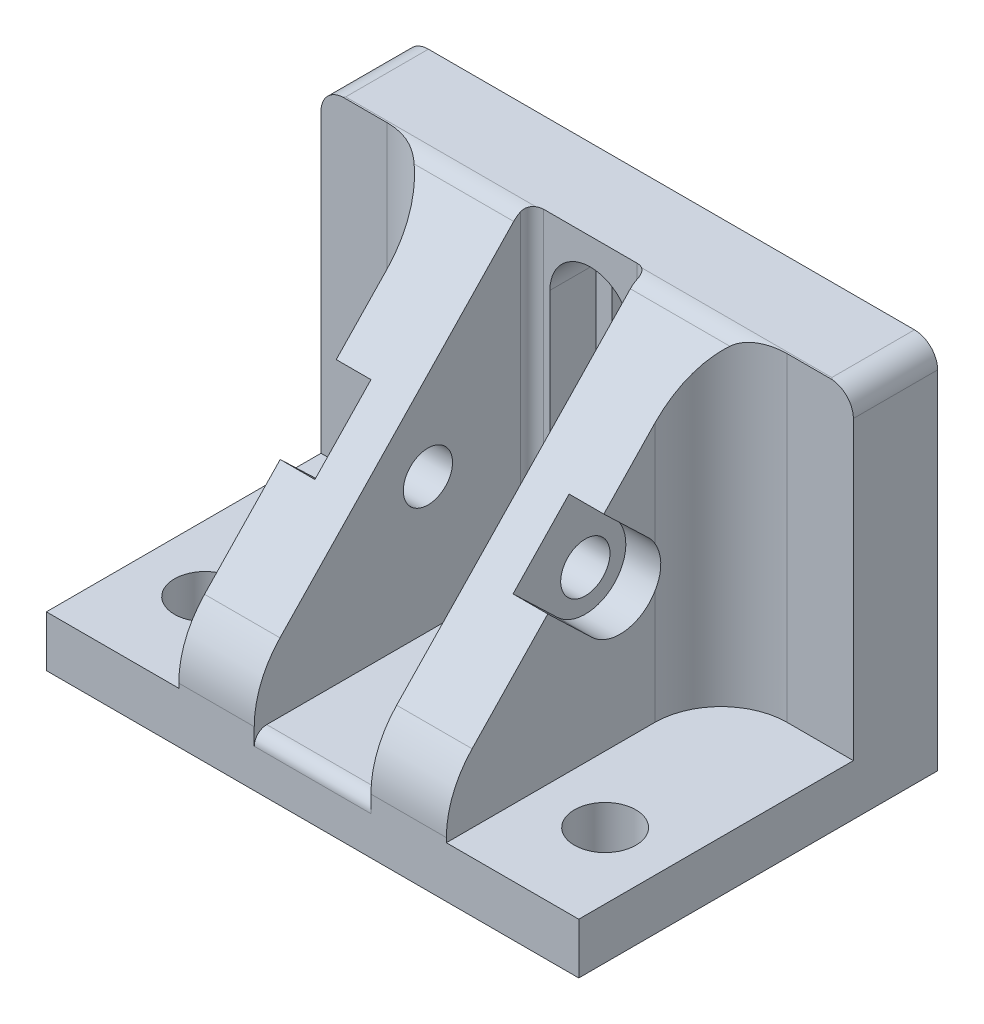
ISO-10303-21;
HEADER;
FILE_DESCRIPTION(('STEP AP214'),'2;1');
FILE_NAME('part.step','',(''),(''),'','','');
FILE_SCHEMA(('AUTOMOTIVE_DESIGN { 1 0 10303 214 1 1 1 1 }'));
ENDSEC;
DATA;
#1=APPLICATION_CONTEXT('core data for automotive mechanical design processes');
#2=APPLICATION_PROTOCOL_DEFINITION('international standard','automotive_design',2000,#1);
#3=PRODUCT_CONTEXT('',#1,'mechanical');
#4=PRODUCT('Part','Part','',(#3));
#5=PRODUCT_RELATED_PRODUCT_CATEGORY('part','',(#4));
#6=PRODUCT_DEFINITION_FORMATION('','',#4);
#7=PRODUCT_DEFINITION_CONTEXT('part definition',#1,'design');
#8=PRODUCT_DEFINITION('design','',#6,#7);
#9=PRODUCT_DEFINITION_SHAPE('','',#8);
#10=(LENGTH_UNIT() NAMED_UNIT(*) SI_UNIT(.MILLI.,.METRE.));
#11=(NAMED_UNIT(*) PLANE_ANGLE_UNIT() SI_UNIT($,.RADIAN.));
#12=(NAMED_UNIT(*) SI_UNIT($,.STERADIAN.) SOLID_ANGLE_UNIT());
#13=UNCERTAINTY_MEASURE_WITH_UNIT(LENGTH_MEASURE(1.E-05),#10,'distance_accuracy_value','');
#14=(GEOMETRIC_REPRESENTATION_CONTEXT(3) GLOBAL_UNCERTAINTY_ASSIGNED_CONTEXT((#13)) GLOBAL_UNIT_ASSIGNED_CONTEXT((#10,
#11,#12)) REPRESENTATION_CONTEXT('',''));
#15=CARTESIAN_POINT('',(0.,0.,0.));
#16=DIRECTION('',(0.,0.,1.));
#17=DIRECTION('',(1.,0.,0.));
#18=AXIS2_PLACEMENT_3D('',#15,#16,#17);
#19=CARTESIAN_POINT('',(36.5125,12.7,0.));
#20=DIRECTION('',(0.,-0.692030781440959,-0.721867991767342));
#21=DIRECTION('',(0.,0.721867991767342,-0.692030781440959));
#22=AXIS2_PLACEMENT_3D('',#19,#20,#21);
#23=PLANE('',#22);
#24=DIRECTION('',(1.,0.,0.));
#25=VECTOR('',#24,1.);
#26=CARTESIAN_POINT('',(-36.5125,35.230759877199,-21.5994884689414));
#27=LINE('',#26,#25);
#28=CARTESIAN_POINT('',(-18.3515,35.230759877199,-21.5994884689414));
#29=VERTEX_POINT('',#28);
#30=CARTESIAN_POINT('',(-13.589,35.230759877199,-21.5994884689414));
#31=VERTEX_POINT('',#30);
#32=EDGE_CURVE('E349',#29,#31,#27,.T.);
#33=ORIENTED_EDGE('',*,*,#32,.T.);
#34=DIRECTION('',(0.,0.721867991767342,-0.692030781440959));
#35=VECTOR('',#34,1.);
#36=CARTESIAN_POINT('',(-13.589,12.7,0.));
#37=LINE('',#36,#35);
#38=CARTESIAN_POINT('',(-13.589,27.2090018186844,-13.9092964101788));
#39=VERTEX_POINT('',#38);
#40=EDGE_CURVE('E429',#39,#31,#37,.T.);
#41=ORIENTED_EDGE('',*,*,#40,.F.);
#42=DIRECTION('',(1.,0.,0.));
#43=VECTOR('',#42,1.);
#44=CARTESIAN_POINT('',(-36.5125,27.2090018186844,-13.9092964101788));
#45=LINE('',#44,#43);
#46=CARTESIAN_POINT('',(-18.3515,27.2090018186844,-13.9092964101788));
#47=VERTEX_POINT('',#46);
#48=EDGE_CURVE('E352',#47,#39,#45,.T.);
#49=ORIENTED_EDGE('',*,*,#48,.F.);
#50=DIRECTION('',(0.,0.721867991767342,-0.692030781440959));
#51=VECTOR('',#50,1.);
#52=CARTESIAN_POINT('',(-18.3515,12.7,0.));
#53=LINE('',#52,#51);
#54=CARTESIAN_POINT('',(-18.3515,16.3845721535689,-3.53227650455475));
#55=VERTEX_POINT('',#54);
#56=EDGE_CURVE('E717',#55,#47,#53,.T.);
#57=ORIENTED_EDGE('',*,*,#56,.F.);
#58=DIRECTION('',(-1.,0.,0.));
#59=VECTOR('',#58,1.);
#60=CARTESIAN_POINT('',(36.5125,16.3845721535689,-3.53227650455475));
#61=LINE('',#60,#59);
#62=CARTESIAN_POINT('',(-8.001,16.3845721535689,-3.53227650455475));
#63=VERTEX_POINT('',#62);
#64=EDGE_CURVE('E761',#55,#63,#61,.F.);
#65=ORIENTED_EDGE('',*,*,#64,.T.);
#66=DIRECTION('',(0.,0.721867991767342,-0.692030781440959));
#67=VECTOR('',#66,1.);
#68=CARTESIAN_POINT('',(-8.00099999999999,12.7,0.));
#69=LINE('',#68,#67);
#70=CARTESIAN_POINT('',(-8.001,49.822197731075,-35.5878135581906));
#71=VERTEX_POINT('',#70);
#72=EDGE_CURVE('E645',#63,#71,#69,.T.);
#73=ORIENTED_EDGE('',*,*,#72,.T.);
#74=DIRECTION('',(-1.,0.,0.));
#75=VECTOR('',#74,1.);
#76=CARTESIAN_POINT('',(36.5125,49.822197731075,-35.5878135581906));
#77=LINE('',#76,#75);
#78=CARTESIAN_POINT('',(-21.6480661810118,49.822197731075,-35.5878135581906));
#79=VERTEX_POINT('',#78);
#80=EDGE_CURVE('E750',#71,#79,#77,.T.);
#81=ORIENTED_EDGE('',*,*,#80,.T.);
#82=CARTESIAN_POINT('',(-27.432,42.5202712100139,-28.5877));
#83=DIRECTION('',(0.,-0.692030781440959,-0.721867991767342));
#84=DIRECTION('',(0.,-0.721867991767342,0.692030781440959));
#85=AXIS2_PLACEMENT_3D('',#82,#83,#84);
#86=ELLIPSE('',#85,13.1215261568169,9.08049999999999);
#87=CARTESIAN_POINT('',(-18.3515,42.5202712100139,-28.5877));
#88=VERTEX_POINT('',#87);
#89=EDGE_CURVE('E722',#88,#79,#86,.F.);
#90=ORIENTED_EDGE('',*,*,#89,.F.);
#91=EDGE_CURVE('E716',#29,#88,#53,.T.);
#92=ORIENTED_EDGE('',*,*,#91,.F.);
#93=EDGE_LOOP('',(#33,#41,#49,#57,#65,#73,#81,#90,#92));
#94=FACE_BOUND('',#93,.T.);
#95=ADVANCED_FACE('F36',(#94),#23,.F.);
#96=CARTESIAN_POINT('',(-18.3515,50.8,-28.5877));
#97=DIRECTION('',(-1.,0.,0.));
#98=DIRECTION('',(0.,0.,1.));
#99=AXIS2_PLACEMENT_3D('',#96,#97,#98);
#100=PLANE('',#99);
#101=ORIENTED_EDGE('',*,*,#56,.T.);
#102=DIRECTION('',(0.,-0.692030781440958,-0.721867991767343));
#103=VECTOR('',#102,1.);
#104=CARTESIAN_POINT('',(-18.3515,31.1742186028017,-9.77311756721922));
#105=LINE('',#104,#103);
#106=CARTESIAN_POINT('',(-18.3515,21.3891209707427,-19.9801039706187));
#107=VERTEX_POINT('',#106);
#108=EDGE_CURVE('E433',#47,#107,#105,.T.);
#109=ORIENTED_EDGE('',*,*,#108,.T.);
#110=CARTESIAN_POINT('',(-18.3515,25.4,-23.8252));
#111=DIRECTION('',(-1.,0.,0.));
#112=DIRECTION('',(0.,0.,1.));
#113=AXIS2_PLACEMENT_3D('',#110,#111,#112);
#114=CIRCLE('',#113,5.55625);
#115=CARTESIAN_POINT('',(-18.3515,22.5380936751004,-28.5877));
#116=VERTEX_POINT('',#115);
#117=EDGE_CURVE('E850',#116,#107,#114,.T.);
#118=ORIENTED_EDGE('',*,*,#117,.F.);
#119=DIRECTION('',(0.,-1.,0.));
#120=VECTOR('',#119,1.);
#121=CARTESIAN_POINT('',(-18.3515,50.8,-28.5877));
#122=LINE('',#121,#120);
#123=CARTESIAN_POINT('',(-18.3515,6.985,-28.5877));
#124=VERTEX_POINT('',#123);
#125=EDGE_CURVE('E689',#116,#124,#122,.T.);
#126=ORIENTED_EDGE('',*,*,#125,.T.);
#127=DIRECTION('',(0.,0.,-1.));
#128=VECTOR('',#127,1.);
#129=CARTESIAN_POINT('',(-18.3515,6.985,-28.5877));
#130=LINE('',#129,#128);
#131=CARTESIAN_POINT('',(-18.3515,6.985,0.));
#132=VERTEX_POINT('',#131);
#133=EDGE_CURVE('E686',#132,#124,#130,.T.);
#134=ORIENTED_EDGE('',*,*,#133,.F.);
#135=DIRECTION('',(0.,-1.,0.));
#136=VECTOR('',#135,1.);
#137=CARTESIAN_POINT('',(-18.3515,50.8,0.));
#138=LINE('',#137,#136);
#139=CARTESIAN_POINT('',(-18.3515,7.59578122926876,0.));
#140=VERTEX_POINT('',#139);
#141=EDGE_CURVE('E693',#140,#132,#138,.T.);
#142=ORIENTED_EDGE('',*,*,#141,.F.);
#143=CARTESIAN_POINT('',(-18.3515,7.59578122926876,-12.7));
#144=DIRECTION('',(-1.,0.,0.));
#145=DIRECTION('',(0.,0.,1.));
#146=AXIS2_PLACEMENT_3D('',#143,#144,#145);
#147=CIRCLE('',#146,12.7);
#148=EDGE_CURVE('E766',#55,#140,#147,.F.);
#149=ORIENTED_EDGE('',*,*,#148,.F.);
#150=EDGE_LOOP('',(#101,#109,#118,#126,#134,#142,#149));
#151=FACE_BOUND('',#150,.T.);
#152=ADVANCED_FACE('F510',(#151),#100,.T.);
#153=DIRECTION('',(0.,0.692030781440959,0.721867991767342));
#154=VECTOR('',#153,1.);
#155=CARTESIAN_POINT('',(-18.3515,39.1959766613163,-17.4633096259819));
#156=LINE('',#155,#154);
#157=CARTESIAN_POINT('',(-18.3515,29.4108790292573,-27.6702960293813));
#158=VERTEX_POINT('',#157);
#159=EDGE_CURVE('E431',#158,#29,#156,.T.);
#160=ORIENTED_EDGE('',*,*,#159,.T.);
#161=ORIENTED_EDGE('',*,*,#91,.T.);
#162=CARTESIAN_POINT('',(-18.3515,28.2619063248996,-28.5877));
#163=VERTEX_POINT('',#162);
#164=EDGE_CURVE('E690',#88,#163,#122,.T.);
#165=ORIENTED_EDGE('',*,*,#164,.T.);
#166=EDGE_CURVE('E854',#158,#163,#114,.T.);
#167=ORIENTED_EDGE('',*,*,#166,.F.);
#168=EDGE_LOOP('',(#160,#161,#165,#167));
#169=FACE_BOUND('',#168,.T.);
#170=ADVANCED_FACE('F512',(#169),#100,.T.);
#171=CARTESIAN_POINT('',(18.3515,50.8,-28.5877));
#172=DIRECTION('',(1.,0.,0.));
#173=DIRECTION('',(0.,0.,-1.));
#174=AXIS2_PLACEMENT_3D('',#171,#172,#173);
#175=PLANE('',#174);
#176=DIRECTION('',(0.,-0.721867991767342,0.692030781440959));
#177=VECTOR('',#176,1.);
#178=CARTESIAN_POINT('',(18.3515,12.7,0.));
#179=LINE('',#178,#177);
#180=CARTESIAN_POINT('',(18.3515,42.5202712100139,-28.5877));
#181=VERTEX_POINT('',#180);
#182=CARTESIAN_POINT('',(18.3515,35.230759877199,-21.5994884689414));
#183=VERTEX_POINT('',#182);
#184=EDGE_CURVE('E714',#181,#183,#179,.T.);
#185=ORIENTED_EDGE('',*,*,#184,.T.);
#186=DIRECTION('',(0.,0.692030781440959,0.721867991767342));
#187=VECTOR('',#186,1.);
#188=CARTESIAN_POINT('',(18.3515,39.1959766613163,-17.4633096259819));
#189=LINE('',#188,#187);
#190=CARTESIAN_POINT('',(18.3515,29.4108790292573,-27.6702960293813));
#191=VERTEX_POINT('',#190);
#192=EDGE_CURVE('E348',#191,#183,#189,.T.);
#193=ORIENTED_EDGE('',*,*,#192,.F.);
#194=CARTESIAN_POINT('',(18.3515,25.4,-23.8252000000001));
#195=DIRECTION('',(1.,0.,0.));
#196=DIRECTION('',(0.,0.,-1.));
#197=AXIS2_PLACEMENT_3D('',#194,#195,#196);
#198=CIRCLE('',#197,5.55625);
#199=CARTESIAN_POINT('',(18.3515,28.2619063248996,-28.5877));
#200=VERTEX_POINT('',#199);
#201=EDGE_CURVE('E785',#200,#191,#198,.T.);
#202=ORIENTED_EDGE('',*,*,#201,.F.);
#203=DIRECTION('',(0.,-1.,0.));
#204=VECTOR('',#203,1.);
#205=CARTESIAN_POINT('',(18.3515,50.8,-28.5877));
#206=LINE('',#205,#204);
#207=EDGE_CURVE('E684',#181,#200,#206,.T.);
#208=ORIENTED_EDGE('',*,*,#207,.F.);
#209=EDGE_LOOP('',(#185,#193,#202,#208));
#210=FACE_BOUND('',#209,.T.);
#211=ADVANCED_FACE('F782',(#210),#175,.T.);
#212=CARTESIAN_POINT('',(27.432,50.8,-28.5877));
#213=DIRECTION('',(0.,-1.,0.));
#214=DIRECTION('',(0.,0.,-1.));
#215=AXIS2_PLACEMENT_3D('',#212,#213,#214);
#216=CYLINDRICAL_SURFACE('',#215,9.08049999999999);
#217=ORIENTED_EDGE('',*,*,#207,.T.);
#218=CARTESIAN_POINT('',(18.3515,28.2619063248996,-28.5877));
#219=CARTESIAN_POINT('',(18.3515171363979,28.1280456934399,-28.6681596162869));
#220=CARTESIAN_POINT('',(18.3525703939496,27.9907854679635,-28.7429415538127));
#221=CARTESIAN_POINT('',(18.3559616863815,27.7104836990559,-28.8806834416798));
#222=CARTESIAN_POINT('',(18.3582996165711,27.5674426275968,-28.9436443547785));
#223=CARTESIAN_POINT('',(18.3634706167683,27.2767116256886,-29.0572374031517));
#224=CARTESIAN_POINT('',(18.3663032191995,27.1290261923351,-29.1078810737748));
#225=CARTESIAN_POINT('',(18.3718265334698,26.8299171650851,-29.1965666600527));
#226=CARTESIAN_POINT('',(18.374517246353,26.6784935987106,-29.2346086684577));
#227=CARTESIAN_POINT('',(18.3792546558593,26.3729166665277,-29.29783195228));
#228=CARTESIAN_POINT('',(18.3813011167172,26.2187623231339,-29.3230085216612));
#229=CARTESIAN_POINT('',(18.3844079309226,25.9088686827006,-29.3602991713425));
#230=CARTESIAN_POINT('',(18.3854682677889,25.753129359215,-29.372413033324));
#231=CARTESIAN_POINT('',(18.3864359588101,25.4411380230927,-29.3834905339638));
#232=CARTESIAN_POINT('',(18.3863430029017,25.2848858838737,-29.3824506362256));
#233=CARTESIAN_POINT('',(18.3850177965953,24.973035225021,-29.3672199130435));
#234=CARTESIAN_POINT('',(18.3837855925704,24.8174366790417,-29.3530296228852));
#235=CARTESIAN_POINT('',(18.3803796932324,24.5082273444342,-29.311633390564));
#236=CARTESIAN_POINT('',(18.3782073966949,24.3546139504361,-29.2844467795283));
#237=CARTESIAN_POINT('',(18.3732878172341,24.0502277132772,-29.2172606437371));
#238=CARTESIAN_POINT('',(18.3705405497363,23.8994547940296,-29.1772614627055));
#239=CARTESIAN_POINT('',(18.3649990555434,23.6020328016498,-29.0848053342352));
#240=CARTESIAN_POINT('',(18.3622049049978,23.4553779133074,-29.0323670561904));
#241=CARTESIAN_POINT('',(18.3572258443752,23.1670394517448,-28.9153850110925));
#242=CARTESIAN_POINT('',(18.3550405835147,23.0253530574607,-28.8508482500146));
#243=CARTESIAN_POINT('',(18.3529088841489,22.8273908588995,-28.7504428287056));
#244=CARTESIAN_POINT('',(18.3523970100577,22.7686727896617,-28.71932383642));
#245=CARTESIAN_POINT('',(18.3516929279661,22.652466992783,-28.6550423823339));
#246=CARTESIAN_POINT('',(18.3515002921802,22.5949777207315,-28.621882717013));
#247=CARTESIAN_POINT('',(18.3515,22.5380936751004,-28.5877));
#248=B_SPLINE_CURVE_WITH_KNOTS('',3,(#218,#219,#220,#221,#222,#223,#224,#225,#226,#227,#228,
#229,#230,#231,#232,#233,#234,#235,#236,#237,#238,#239,#240,#241,#242,#243,#244,#245,#246,#247),
.UNSPECIFIED.,.F.,.F.,(4,2,2,2,2,2,2,2,2,2,2,2,2,2,4),(0.,0.46838495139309,0.936731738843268,
1.40463820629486,1.87254122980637,2.34061528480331,2.80869716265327,3.27690488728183,
3.74509355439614,4.2125879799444,4.68006986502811,5.14685451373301,5.61336968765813,
5.81270357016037,6.01177012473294),.UNSPECIFIED.);
#249=CARTESIAN_POINT('',(18.3515,22.5380936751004,-28.5877));
#250=VERTEX_POINT('',#249);
#251=EDGE_CURVE('E436',#200,#250,#248,.T.);
#252=ORIENTED_EDGE('',*,*,#251,.T.);
#253=CARTESIAN_POINT('',(18.3515,6.985,-28.5877));
#254=VERTEX_POINT('',#253);
#255=EDGE_CURVE('E706',#250,#254,#206,.T.);
#256=ORIENTED_EDGE('',*,*,#255,.T.);
#257=CARTESIAN_POINT('',(27.432,6.985,-28.5877));
#258=DIRECTION('',(0.,1.,0.));
#259=DIRECTION('',(0.,0.,-1.));
#260=AXIS2_PLACEMENT_3D('',#257,#258,#259);
#261=CIRCLE('',#260,9.08049999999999);
#262=CARTESIAN_POINT('',(27.432,6.985,-37.6682));
#263=VERTEX_POINT('',#262);
#264=EDGE_CURVE('E679',#263,#254,#261,.T.);
#265=ORIENTED_EDGE('',*,*,#264,.F.);
#266=DIRECTION('',(0.,1.,0.));
#267=VECTOR('',#266,1.);
#268=CARTESIAN_POINT('',(27.432,-5.85676625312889,-37.6682));
#269=LINE('',#268,#267);
#270=CARTESIAN_POINT('',(27.432,50.7929447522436,-37.6682));
#271=VERTEX_POINT('',#270);
#272=EDGE_CURVE('E663',#263,#271,#269,.T.);
#273=ORIENTED_EDGE('',*,*,#272,.T.);
#274=CARTESIAN_POINT('',(21.6480661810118,49.822197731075,-35.5878135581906));
#275=CARTESIAN_POINT('',(21.6920495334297,49.860107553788,-35.6241582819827));
#276=CARTESIAN_POINT('',(21.7371862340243,49.8963985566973,-35.6607521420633));
#277=CARTESIAN_POINT('',(21.8295847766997,49.9658648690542,-35.7341604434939));
#278=CARTESIAN_POINT('',(21.8768456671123,49.9990415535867,-35.7709747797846));
#279=CARTESIAN_POINT('',(22.0213047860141,50.0939353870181,-35.8811539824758));
#280=CARTESIAN_POINT('',(22.1214529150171,50.1512484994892,-35.9544825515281));
#281=CARTESIAN_POINT('',(22.32685965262,50.2545780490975,-36.098261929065));
#282=CARTESIAN_POINT('',(22.4320287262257,50.3007393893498,-36.1687384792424));
#283=CARTESIAN_POINT('',(22.6478177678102,50.384124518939,-36.3067354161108));
#284=CARTESIAN_POINT('',(22.7584424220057,50.421340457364,-36.3742531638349));
#285=CARTESIAN_POINT('',(23.027017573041,50.5007229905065,-36.5302428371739));
#286=CARTESIAN_POINT('',(23.1870139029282,50.5394198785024,-36.6169577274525));
#287=CARTESIAN_POINT('',(23.5137956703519,50.6052847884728,-36.7813964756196));
#288=CARTESIAN_POINT('',(23.6805823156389,50.6324507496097,-36.8591187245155));
#289=CARTESIAN_POINT('',(24.0206869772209,50.6781195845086,-37.0051162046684));
#290=CARTESIAN_POINT('',(24.1940408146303,50.6965641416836,-37.0733257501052));
#291=CARTESIAN_POINT('',(24.5451052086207,50.7268567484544,-37.1990940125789));
#292=CARTESIAN_POINT('',(24.7228159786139,50.7387044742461,-37.2566522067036));
#293=CARTESIAN_POINT('',(25.1426985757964,50.7609825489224,-37.3784466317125));
#294=CARTESIAN_POINT('',(25.3862485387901,50.7695621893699,-37.4383023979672));
#295=CARTESIAN_POINT('',(25.8776065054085,50.7819157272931,-37.5376840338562));
#296=CARTESIAN_POINT('',(26.1254155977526,50.7856883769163,-37.5772046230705));
#297=CARTESIAN_POINT('',(26.6232455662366,50.7907336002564,-37.6355805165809));
#298=CARTESIAN_POINT('',(26.8732641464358,50.7920085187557,-37.6544551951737));
#299=CARTESIAN_POINT('',(27.3739761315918,50.7931727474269,-37.6714689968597));
#300=CARTESIAN_POINT('',(27.6246694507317,50.7930622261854,-37.6696106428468));
#301=CARTESIAN_POINT('',(28.1262910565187,50.7913428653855,-37.6451174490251));
#302=CARTESIAN_POINT('',(28.3772142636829,50.7897265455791,-37.6223788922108));
#303=CARTESIAN_POINT('',(28.8763351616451,50.783639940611,-37.556131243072));
#304=CARTESIAN_POINT('',(29.1245322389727,50.7791690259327,-37.5126175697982));
#305=CARTESIAN_POINT('',(29.6163049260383,50.7647984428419,-37.405162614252));
#306=CARTESIAN_POINT('',(29.8598806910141,50.7548989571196,-37.3412220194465));
#307=CARTESIAN_POINT('',(30.3403300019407,50.7258711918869,-37.1935206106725));
#308=CARTESIAN_POINT('',(30.5772074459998,50.7067484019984,-37.1097716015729));
#309=CARTESIAN_POINT('',(30.9464437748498,50.6649456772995,-36.9618250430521));
#310=CARTESIAN_POINT('',(31.0817974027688,50.6469470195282,-36.9037108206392));
#311=CARTESIAN_POINT('',(31.3486998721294,50.604668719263,-36.7813845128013));
#312=CARTESIAN_POINT('',(31.4802498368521,50.5803909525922,-36.7171742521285));
#313=CARTESIAN_POINT('',(31.7381659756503,50.5242578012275,-36.5835368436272));
#314=CARTESIAN_POINT('',(31.8645548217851,50.4924409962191,-36.5141374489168));
#315=CARTESIAN_POINT('',(32.1119179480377,50.4195882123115,-36.3706470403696));
#316=CARTESIAN_POINT('',(32.2328935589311,50.3785545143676,-36.2965571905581));
#317=CARTESIAN_POINT('',(32.429433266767,50.3009386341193,-36.1699131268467));
#318=CARTESIAN_POINT('',(32.5068083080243,50.267356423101,-36.1183210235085));
#319=CARTESIAN_POINT('',(32.6581927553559,50.1948017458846,-36.0140605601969));
#320=CARTESIAN_POINT('',(32.7322037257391,50.1558318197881,-35.961392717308));
#321=CARTESIAN_POINT('',(32.8770787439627,50.0716247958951,-35.8550737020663));
#322=CARTESIAN_POINT('',(32.9479094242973,50.0263356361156,-35.8014179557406));
#323=CARTESIAN_POINT('',(33.085293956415,49.9292517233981,-35.6942759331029));
#324=CARTESIAN_POINT('',(33.1518417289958,49.8774480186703,-35.6407899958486));
#325=CARTESIAN_POINT('',(33.2159338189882,49.8221977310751,-35.5878135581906));
#326=B_SPLINE_CURVE_WITH_KNOTS('',3,(#274,#275,#276,#277,#278,#279,#280,#281,#282,#283,#284,
#285,#286,#287,#288,#289,#290,#291,#292,#293,#294,#295,#296,#297,#298,#299,#300,#301,#302,#303,
#304,#305,#306,#307,#308,#309,#310,#311,#312,#313,#314,#315,#316,#317,#318,#319,#320,#321,#322,
#323,#324,#325),.UNSPECIFIED.,.F.,.F.,(4,2,2,2,2,2,2,2,2,2,2,2,2,2,2,2,2,2,2,2,2,2,2,2,2,4),(0.,
0.205440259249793,0.410789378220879,0.820219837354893,1.22400337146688,1.62814000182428,
2.18544912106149,2.7428578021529,3.30394271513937,3.86505516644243,4.61689865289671,
5.36893727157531,6.12026956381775,6.87151043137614,7.626503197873,8.3816625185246,
9.13679642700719,9.89148144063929,10.3364198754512,10.7812255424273,11.2238023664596,
11.6662697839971,11.9627150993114,12.2590211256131,12.5579308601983,12.8572559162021),.UNSPECIFIED.);
#327=CARTESIAN_POINT('',(21.6480661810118,49.822197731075,-35.5878135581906));
#328=VERTEX_POINT('',#327);
#329=EDGE_CURVE('E529',#328,#271,#326,.T.);
#330=ORIENTED_EDGE('',*,*,#329,.F.);
#331=CARTESIAN_POINT('',(27.432,42.5202712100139,-28.5877));
#332=DIRECTION('',(0.,-0.692030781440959,-0.721867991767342));
#333=DIRECTION('',(0.,-0.721867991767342,0.692030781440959));
#334=AXIS2_PLACEMENT_3D('',#331,#332,#333);
#335=ELLIPSE('',#334,13.1215261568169,9.08049999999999);
#336=EDGE_CURVE('E720',#328,#181,#335,.F.);
#337=ORIENTED_EDGE('',*,*,#336,.T.);
#338=EDGE_LOOP('',(#217,#252,#256,#265,#273,#330,#337));
#339=FACE_BOUND('',#338,.T.);
#340=ADVANCED_FACE('F453',(#339),#216,.F.);
#341=CARTESIAN_POINT('',(-27.432,50.8,-28.5877));
#342=DIRECTION('',(0.,-1.,0.));
#343=DIRECTION('',(0.,0.,-1.));
#344=AXIS2_PLACEMENT_3D('',#341,#342,#343);
#345=CYLINDRICAL_SURFACE('',#344,9.08049999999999);
#346=ORIENTED_EDGE('',*,*,#125,.F.);
#347=CARTESIAN_POINT('',(-18.3515,22.5380936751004,-28.5877));
#348=CARTESIAN_POINT('',(-18.3515171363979,22.6719543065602,-28.6681596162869));
#349=CARTESIAN_POINT('',(-18.3525703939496,22.8092145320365,-28.7429415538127));
#350=CARTESIAN_POINT('',(-18.3559616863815,23.0895163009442,-28.8806834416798));
#351=CARTESIAN_POINT('',(-18.3582996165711,23.2325573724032,-28.9436443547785));
#352=CARTESIAN_POINT('',(-18.3634706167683,23.5232883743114,-29.0572374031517));
#353=CARTESIAN_POINT('',(-18.3663032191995,23.6709738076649,-29.1078810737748));
#354=CARTESIAN_POINT('',(-18.3718265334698,23.9700828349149,-29.1965666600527));
#355=CARTESIAN_POINT('',(-18.374517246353,24.1215064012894,-29.2346086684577));
#356=CARTESIAN_POINT('',(-18.3792546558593,24.4270833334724,-29.29783195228));
#357=CARTESIAN_POINT('',(-18.3813011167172,24.5812376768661,-29.3230085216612));
#358=CARTESIAN_POINT('',(-18.3844079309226,24.8911313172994,-29.3602991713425));
#359=CARTESIAN_POINT('',(-18.3854682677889,25.0468706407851,-29.372413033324));
#360=CARTESIAN_POINT('',(-18.3864359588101,25.3588619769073,-29.3834905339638));
#361=CARTESIAN_POINT('',(-18.3863430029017,25.5151141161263,-29.3824506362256));
#362=CARTESIAN_POINT('',(-18.3850177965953,25.8269647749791,-29.3672199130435));
#363=CARTESIAN_POINT('',(-18.3837855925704,25.9825633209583,-29.3530296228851));
#364=CARTESIAN_POINT('',(-18.3803796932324,26.2917726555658,-29.311633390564));
#365=CARTESIAN_POINT('',(-18.3782073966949,26.4453860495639,-29.2844467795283));
#366=CARTESIAN_POINT('',(-18.3732878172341,26.7497722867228,-29.217260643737));
#367=CARTESIAN_POINT('',(-18.3705405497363,26.9005452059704,-29.1772614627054));
#368=CARTESIAN_POINT('',(-18.3649990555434,27.1979671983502,-29.0848053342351));
#369=CARTESIAN_POINT('',(-18.3622049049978,27.3446220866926,-29.0323670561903));
#370=CARTESIAN_POINT('',(-18.3572258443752,27.6329605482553,-28.9153850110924));
#371=CARTESIAN_POINT('',(-18.3550405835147,27.7746469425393,-28.8508482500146));
#372=CARTESIAN_POINT('',(-18.3529088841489,27.9726091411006,-28.7504428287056));
#373=CARTESIAN_POINT('',(-18.3523970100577,28.0313272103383,-28.71932383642));
#374=CARTESIAN_POINT('',(-18.3516929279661,28.147533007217,-28.6550423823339));
#375=CARTESIAN_POINT('',(-18.3515002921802,28.2050222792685,-28.621882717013));
#376=CARTESIAN_POINT('',(-18.3515,28.2619063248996,-28.5877));
#377=B_SPLINE_CURVE_WITH_KNOTS('',3,(#347,#348,#349,#350,#351,#352,#353,#354,#355,#356,#357,
#358,#359,#360,#361,#362,#363,#364,#365,#366,#367,#368,#369,#370,#371,#372,#373,#374,#375,#376),
.UNSPECIFIED.,.F.,.F.,(4,2,2,2,2,2,2,2,2,2,2,2,2,2,4),(0.,0.468384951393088,0.936731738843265,
1.40463820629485,1.87254122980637,2.3406152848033,2.80869716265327,3.27690488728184,
3.74509355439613,4.21258797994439,4.68006986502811,5.146854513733,5.61336968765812,
5.81270357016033,6.01177012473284),.UNSPECIFIED.);
#378=EDGE_CURVE('E445',#116,#163,#377,.T.);
#379=ORIENTED_EDGE('',*,*,#378,.T.);
#380=ORIENTED_EDGE('',*,*,#164,.F.);
#381=ORIENTED_EDGE('',*,*,#89,.T.);
#382=CARTESIAN_POINT('',(-33.2159338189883,49.822197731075,-35.5878135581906));
#383=CARTESIAN_POINT('',(-33.1719504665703,49.860107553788,-35.6241582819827));
#384=CARTESIAN_POINT('',(-33.1268137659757,49.8963985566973,-35.6607521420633));
#385=CARTESIAN_POINT('',(-33.0344152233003,49.9658648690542,-35.7341604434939));
#386=CARTESIAN_POINT('',(-32.9871543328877,49.9990415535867,-35.7709747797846));
#387=CARTESIAN_POINT('',(-32.8426952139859,50.0939353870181,-35.8811539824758));
#388=CARTESIAN_POINT('',(-32.7425470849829,50.1512484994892,-35.9544825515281));
#389=CARTESIAN_POINT('',(-32.53714034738,50.2545780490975,-36.098261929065));
#390=CARTESIAN_POINT('',(-32.4319712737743,50.3007393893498,-36.1687384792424));
#391=CARTESIAN_POINT('',(-32.2161822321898,50.384124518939,-36.3067354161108));
#392=CARTESIAN_POINT('',(-32.1055575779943,50.421340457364,-36.3742531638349));
#393=CARTESIAN_POINT('',(-31.836982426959,50.5007229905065,-36.5302428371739));
#394=CARTESIAN_POINT('',(-31.6769860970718,50.5394198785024,-36.6169577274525));
#395=CARTESIAN_POINT('',(-31.3502043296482,50.6052847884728,-36.7813964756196));
#396=CARTESIAN_POINT('',(-31.1834176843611,50.6324507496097,-36.8591187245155));
#397=CARTESIAN_POINT('',(-30.8433130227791,50.6781195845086,-37.0051162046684));
#398=CARTESIAN_POINT('',(-30.6699591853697,50.6965641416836,-37.0733257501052));
#399=CARTESIAN_POINT('',(-30.3188947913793,50.7268567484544,-37.1990940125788));
#400=CARTESIAN_POINT('',(-30.1411840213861,50.7387044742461,-37.2566522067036));
#401=CARTESIAN_POINT('',(-29.7213014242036,50.7609825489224,-37.3784466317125));
#402=CARTESIAN_POINT('',(-29.4777514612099,50.7695621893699,-37.4383023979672));
#403=CARTESIAN_POINT('',(-28.9863934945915,50.7819157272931,-37.5376840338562));
#404=CARTESIAN_POINT('',(-28.7385844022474,50.7856883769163,-37.5772046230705));
#405=CARTESIAN_POINT('',(-28.2407544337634,50.7907336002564,-37.6355805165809));
#406=CARTESIAN_POINT('',(-27.9907358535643,50.7920085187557,-37.6544551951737));
#407=CARTESIAN_POINT('',(-27.4900238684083,50.7931727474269,-37.6714689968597));
#408=CARTESIAN_POINT('',(-27.2393305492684,50.7930622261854,-37.6696106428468));
#409=CARTESIAN_POINT('',(-26.7377089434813,50.7913428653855,-37.6451174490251));
#410=CARTESIAN_POINT('',(-26.4867857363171,50.7897265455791,-37.6223788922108));
#411=CARTESIAN_POINT('',(-25.987664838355,50.783639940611,-37.556131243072));
#412=CARTESIAN_POINT('',(-25.7394677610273,50.7791690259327,-37.5126175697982));
#413=CARTESIAN_POINT('',(-25.2476950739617,50.7647984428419,-37.4051626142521));
#414=CARTESIAN_POINT('',(-25.004119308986,50.7548989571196,-37.3412220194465));
#415=CARTESIAN_POINT('',(-24.5236699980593,50.7258711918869,-37.1935206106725));
#416=CARTESIAN_POINT('',(-24.2867925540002,50.7067484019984,-37.1097716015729));
#417=CARTESIAN_POINT('',(-23.9175562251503,50.6649456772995,-36.9618250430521));
#418=CARTESIAN_POINT('',(-23.7822025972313,50.6469470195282,-36.9037108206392));
#419=CARTESIAN_POINT('',(-23.5153001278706,50.604668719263,-36.7813845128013));
#420=CARTESIAN_POINT('',(-23.3837501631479,50.5803909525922,-36.7171742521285));
#421=CARTESIAN_POINT('',(-23.1258340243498,50.5242578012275,-36.5835368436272));
#422=CARTESIAN_POINT('',(-22.999445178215,50.4924409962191,-36.5141374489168));
#423=CARTESIAN_POINT('',(-22.7520820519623,50.4195882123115,-36.3706470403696));
#424=CARTESIAN_POINT('',(-22.6311064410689,50.3785545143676,-36.2965571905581));
#425=CARTESIAN_POINT('',(-22.434566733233,50.3009386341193,-36.1699131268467));
#426=CARTESIAN_POINT('',(-22.3571916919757,50.267356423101,-36.1183210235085));
#427=CARTESIAN_POINT('',(-22.2058072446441,50.1948017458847,-36.0140605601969));
#428=CARTESIAN_POINT('',(-22.1317962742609,50.1558318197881,-35.961392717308));
#429=CARTESIAN_POINT('',(-21.9869212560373,50.0716247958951,-35.8550737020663));
#430=CARTESIAN_POINT('',(-21.9160905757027,50.0263356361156,-35.8014179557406));
#431=CARTESIAN_POINT('',(-21.778706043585,49.9292517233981,-35.6942759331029));
#432=CARTESIAN_POINT('',(-21.7121582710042,49.8774480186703,-35.6407899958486));
#433=CARTESIAN_POINT('',(-21.6480661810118,49.8221977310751,-35.5878135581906));
#434=B_SPLINE_CURVE_WITH_KNOTS('',3,(#382,#383,#384,#385,#386,#387,#388,#389,#390,#391,#392,
#393,#394,#395,#396,#397,#398,#399,#400,#401,#402,#403,#404,#405,#406,#407,#408,#409,#410,#411,
#412,#413,#414,#415,#416,#417,#418,#419,#420,#421,#422,#423,#424,#425,#426,#427,#428,#429,#430,
#431,#432,#433),.UNSPECIFIED.,.F.,.F.,(4,2,2,2,2,2,2,2,2,2,2,2,2,2,2,2,2,2,2,2,2,2,2,2,2,4),(0.,
0.205440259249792,0.410789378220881,0.820219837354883,1.22400337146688,1.62814000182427,
2.18544912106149,2.74285780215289,3.30394271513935,3.86505516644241,4.6168986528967,
5.3689372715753,6.12026956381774,6.87151043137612,7.62650319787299,8.38166251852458,
9.13679642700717,9.89148144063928,10.3364198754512,10.7812255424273,11.2238023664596,
11.6662697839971,11.9627150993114,12.2590211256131,12.5579308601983,12.8572559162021),.UNSPECIFIED.);
#435=CARTESIAN_POINT('',(-27.432,50.7929447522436,-37.6682));
#436=VERTEX_POINT('',#435);
#437=EDGE_CURVE('E519',#436,#79,#434,.T.);
#438=ORIENTED_EDGE('',*,*,#437,.F.);
#439=DIRECTION('',(0.,1.,0.));
#440=VECTOR('',#439,1.);
#441=CARTESIAN_POINT('',(-27.432,-5.85676625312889,-37.6682));
#442=LINE('',#441,#440);
#443=CARTESIAN_POINT('',(-27.432,6.985,-37.6682));
#444=VERTEX_POINT('',#443);
#445=EDGE_CURVE('E666',#444,#436,#442,.T.);
#446=ORIENTED_EDGE('',*,*,#445,.F.);
#447=CARTESIAN_POINT('',(-27.432,6.985,-28.5877));
#448=DIRECTION('',(0.,1.,0.));
#449=DIRECTION('',(0.,0.,1.));
#450=AXIS2_PLACEMENT_3D('',#447,#448,#449);
#451=CIRCLE('',#450,9.08049999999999);
#452=EDGE_CURVE('E680',#124,#444,#451,.T.);
#453=ORIENTED_EDGE('',*,*,#452,.F.);
#454=EDGE_LOOP('',(#346,#379,#380,#381,#438,#446,#453));
#455=FACE_BOUND('',#454,.T.);
#456=ADVANCED_FACE('F497',(#455),#345,.F.);
#457=CARTESIAN_POINT('',(8.001,-70.9671140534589,-38.1127));
#458=DIRECTION('',(1.,0.,0.));
#459=DIRECTION('',(0.,0.,-1.));
#460=AXIS2_PLACEMENT_3D('',#457,#458,#459);
#461=PLANE('',#460);
#462=CARTESIAN_POINT('',(8.001,47.625,-37.8797444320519));
#463=DIRECTION('',(1.,0.,0.));
#464=DIRECTION('',(0.,0.,-1.));
#465=AXIS2_PLACEMENT_3D('',#462,#463,#464);
#466=CIRCLE('',#465,3.175);
#467=CARTESIAN_POINT('',(8.001,49.822197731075,-35.5878135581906));
#468=VERTEX_POINT('',#467);
#469=CARTESIAN_POINT('',(8.001,50.4965560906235,-36.5252));
#470=VERTEX_POINT('',#469);
#471=EDGE_CURVE('E656',#468,#470,#466,.F.);
#472=ORIENTED_EDGE('',*,*,#471,.T.);
#473=DIRECTION('',(0.,1.,0.));
#474=VECTOR('',#473,1.);
#475=CARTESIAN_POINT('',(8.001,6.985,-36.5252));
#476=LINE('',#475,#474);
#477=CARTESIAN_POINT('',(8.001,6.985,-36.5252));
#478=VERTEX_POINT('',#477);
#479=EDGE_CURVE('E562',#470,#478,#476,.F.);
#480=ORIENTED_EDGE('',*,*,#479,.T.);
#481=DIRECTION('',(0.,0.,-1.));
#482=VECTOR('',#481,1.);
#483=CARTESIAN_POINT('',(8.001,6.985,-38.1127));
#484=LINE('',#483,#482);
#485=CARTESIAN_POINT('',(8.001,6.985,-1.7145));
#486=VERTEX_POINT('',#485);
#487=EDGE_CURVE('E628',#486,#478,#484,.T.);
#488=ORIENTED_EDGE('',*,*,#487,.F.);
#489=CARTESIAN_POINT('',(8.001,5.2705,-1.7145));
#490=DIRECTION('',(1.,0.,0.));
#491=DIRECTION('',(0.,0.,-1.));
#492=AXIS2_PLACEMENT_3D('',#489,#490,#491);
#493=CIRCLE('',#492,1.7145);
#494=CARTESIAN_POINT('',(8.001,5.2705,0.));
#495=VERTEX_POINT('',#494);
#496=EDGE_CURVE('E11',#486,#495,#493,.T.);
#497=ORIENTED_EDGE('',*,*,#496,.T.);
#498=DIRECTION('',(0.,-1.,0.));
#499=VECTOR('',#498,1.);
#500=CARTESIAN_POINT('',(8.001,0.,0.));
#501=LINE('',#500,#499);
#502=CARTESIAN_POINT('',(8.00100000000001,7.59578122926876,0.));
#503=VERTEX_POINT('',#502);
#504=EDGE_CURVE('E621',#503,#495,#501,.T.);
#505=ORIENTED_EDGE('',*,*,#504,.F.);
#506=CARTESIAN_POINT('',(8.001,7.59578122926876,-12.7));
#507=DIRECTION('',(1.,0.,0.));
#508=DIRECTION('',(0.,0.,-1.));
#509=AXIS2_PLACEMENT_3D('',#506,#507,#508);
#510=CIRCLE('',#509,12.7);
#511=CARTESIAN_POINT('',(8.00100000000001,16.3845721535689,-3.53227650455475));
#512=VERTEX_POINT('',#511);
#513=EDGE_CURVE('E650',#503,#512,#510,.F.);
#514=ORIENTED_EDGE('',*,*,#513,.T.);
#515=DIRECTION('',(0.,-0.721867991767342,0.692030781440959));
#516=VECTOR('',#515,1.);
#517=CARTESIAN_POINT('',(8.001,12.7,0.));
#518=LINE('',#517,#516);
#519=EDGE_CURVE('E653',#468,#512,#518,.T.);
#520=ORIENTED_EDGE('',*,*,#519,.F.);
#521=EDGE_LOOP('',(#472,#480,#488,#497,#505,#514,#520));
#522=FACE_BOUND('',#521,.T.);
#523=CARTESIAN_POINT('',(8.001,25.4,-23.8252));
#524=DIRECTION('',(1.,0.,0.));
#525=DIRECTION('',(0.,0.,-1.));
#526=AXIS2_PLACEMENT_3D('',#523,#524,#525);
#527=CIRCLE('',#526,3.3782);
#528=CARTESIAN_POINT('',(8.001,25.4,-27.2034));
#529=VERTEX_POINT('',#528);
#530=EDGE_CURVE('E928',#529,#529,#527,.F.);
#531=ORIENTED_EDGE('',*,*,#530,.F.);
#532=EDGE_LOOP('',(#531));
#533=FACE_BOUND('',#532,.T.);
#534=ADVANCED_FACE('F490',(#522,#533),#461,.F.);
#535=CARTESIAN_POINT('',(-8.001,-70.9671140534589,-38.1127));
#536=DIRECTION('',(-1.,0.,0.));
#537=DIRECTION('',(0.,0.,1.));
#538=AXIS2_PLACEMENT_3D('',#535,#536,#537);
#539=PLANE('',#538);
#540=DIRECTION('',(0.,0.,1.));
#541=VECTOR('',#540,1.);
#542=CARTESIAN_POINT('',(-8.001,6.985,-38.1127));
#543=LINE('',#542,#541);
#544=CARTESIAN_POINT('',(-8.001,6.985,-36.5252));
#545=VERTEX_POINT('',#544);
#546=CARTESIAN_POINT('',(-8.00099999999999,6.985,-1.7145));
#547=VERTEX_POINT('',#546);
#548=EDGE_CURVE('E635',#545,#547,#543,.T.);
#549=ORIENTED_EDGE('',*,*,#548,.F.);
#550=DIRECTION('',(0.,1.,0.));
#551=VECTOR('',#550,1.);
#552=CARTESIAN_POINT('',(-8.001,50.8,-36.5252));
#553=LINE('',#552,#551);
#554=CARTESIAN_POINT('',(-8.001,50.4965560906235,-36.5252));
#555=VERTEX_POINT('',#554);
#556=EDGE_CURVE('E829',#545,#555,#553,.T.);
#557=ORIENTED_EDGE('',*,*,#556,.T.);
#558=CARTESIAN_POINT('',(-8.001,47.625,-37.8797444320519));
#559=DIRECTION('',(-1.,0.,0.));
#560=DIRECTION('',(0.,0.,1.));
#561=AXIS2_PLACEMENT_3D('',#558,#559,#560);
#562=CIRCLE('',#561,3.175);
#563=EDGE_CURVE('E648',#555,#71,#562,.F.);
#564=ORIENTED_EDGE('',*,*,#563,.T.);
#565=ORIENTED_EDGE('',*,*,#72,.F.);
#566=CARTESIAN_POINT('',(-8.001,7.59578122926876,-12.7));
#567=DIRECTION('',(-1.,0.,0.));
#568=DIRECTION('',(0.,0.,1.));
#569=AXIS2_PLACEMENT_3D('',#566,#567,#568);
#570=CIRCLE('',#569,12.7);
#571=CARTESIAN_POINT('',(-8.001,7.59578122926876,0.));
#572=VERTEX_POINT('',#571);
#573=EDGE_CURVE('E642',#63,#572,#570,.F.);
#574=ORIENTED_EDGE('',*,*,#573,.T.);
#575=DIRECTION('',(0.,1.,0.));
#576=VECTOR('',#575,1.);
#577=CARTESIAN_POINT('',(-8.00099999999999,0.,0.));
#578=LINE('',#577,#576);
#579=CARTESIAN_POINT('',(-8.00099999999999,5.2705,0.));
#580=VERTEX_POINT('',#579);
#581=EDGE_CURVE('E618',#580,#572,#578,.T.);
#582=ORIENTED_EDGE('',*,*,#581,.F.);
#583=CARTESIAN_POINT('',(-8.00099999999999,5.2705,-1.7145));
#584=DIRECTION('',(-1.,0.,0.));
#585=DIRECTION('',(0.,0.,1.));
#586=AXIS2_PLACEMENT_3D('',#583,#584,#585);
#587=CIRCLE('',#586,1.7145);
#588=EDGE_CURVE('E44',#580,#547,#587,.T.);
#589=ORIENTED_EDGE('',*,*,#588,.T.);
#590=EDGE_LOOP('',(#549,#557,#564,#565,#574,#582,#589));
#591=FACE_BOUND('',#590,.T.);
#592=CARTESIAN_POINT('',(-8.001,25.4,-23.8252));
#593=DIRECTION('',(-1.,0.,0.));
#594=DIRECTION('',(0.,0.,1.));
#595=AXIS2_PLACEMENT_3D('',#592,#593,#594);
#596=CIRCLE('',#595,3.3782);
#597=CARTESIAN_POINT('',(-8.001,25.4,-20.447));
#598=VERTEX_POINT('',#597);
#599=EDGE_CURVE('E638',#598,#598,#596,.F.);
#600=ORIENTED_EDGE('',*,*,#599,.F.);
#601=EDGE_LOOP('',(#600));
#602=FACE_BOUND('',#601,.T.);
#603=ADVANCED_FACE('F487',(#591,#602),#539,.F.);
#604=CARTESIAN_POINT('',(18.3515,27.2090018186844,-13.9092964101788));
#605=VERTEX_POINT('',#604);
#606=CARTESIAN_POINT('',(18.3515,16.3845721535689,-3.53227650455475));
#607=VERTEX_POINT('',#606);
#608=EDGE_CURVE('E713',#605,#607,#179,.T.);
#609=ORIENTED_EDGE('',*,*,#608,.F.);
#610=DIRECTION('',(-1.,0.,0.));
#611=VECTOR('',#610,1.);
#612=CARTESIAN_POINT('',(36.5125,27.2090018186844,-13.9092964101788));
#613=LINE('',#612,#611);
#614=CARTESIAN_POINT('',(13.589,27.2090018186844,-13.9092964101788));
#615=VERTEX_POINT('',#614);
#616=EDGE_CURVE('E332',#605,#615,#613,.T.);
#617=ORIENTED_EDGE('',*,*,#616,.T.);
#618=DIRECTION('',(0.,0.721867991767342,-0.692030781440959));
#619=VECTOR('',#618,1.);
#620=CARTESIAN_POINT('',(13.589,12.7,0.));
#621=LINE('',#620,#619);
#622=CARTESIAN_POINT('',(13.589,35.230759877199,-21.5994884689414));
#623=VERTEX_POINT('',#622);
#624=EDGE_CURVE('E323',#615,#623,#621,.T.);
#625=ORIENTED_EDGE('',*,*,#624,.T.);
#626=DIRECTION('',(-1.,0.,0.));
#627=VECTOR('',#626,1.);
#628=CARTESIAN_POINT('',(36.5125,35.230759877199,-21.5994884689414));
#629=LINE('',#628,#627);
#630=EDGE_CURVE('E329',#183,#623,#629,.T.);
#631=ORIENTED_EDGE('',*,*,#630,.F.);
#632=ORIENTED_EDGE('',*,*,#184,.F.);
#633=ORIENTED_EDGE('',*,*,#336,.F.);
#634=EDGE_CURVE('E751',#328,#468,#77,.T.);
#635=ORIENTED_EDGE('',*,*,#634,.T.);
#636=ORIENTED_EDGE('',*,*,#519,.T.);
#637=EDGE_CURVE('E760',#512,#607,#61,.F.);
#638=ORIENTED_EDGE('',*,*,#637,.T.);
#639=EDGE_LOOP('',(#609,#617,#625,#631,#632,#633,#635,#636,#638));
#640=FACE_BOUND('',#639,.T.);
#641=ADVANCED_FACE('F326',(#640),#23,.F.);
#642=CARTESIAN_POINT('',(36.5125,47.625,-37.8797444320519));
#643=DIRECTION('',(-1.,0.,0.));
#644=DIRECTION('',(0.,0.,1.));
#645=AXIS2_PLACEMENT_3D('',#642,#643,#644);
#646=CYLINDRICAL_SURFACE('',#645,3.175);
#647=DIRECTION('',(-1.,0.,0.));
#648=VECTOR('',#647,1.);
#649=CARTESIAN_POINT('',(36.5125,50.7929447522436,-37.6682));
#650=LINE('',#649,#648);
#651=CARTESIAN_POINT('',(33.5490444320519,50.7929447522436,-37.6682));
#652=VERTEX_POINT('',#651);
#653=EDGE_CURVE('E668',#652,#271,#650,.T.);
#654=ORIENTED_EDGE('',*,*,#653,.F.);
#655=CARTESIAN_POINT('',(33.3375,47.625,-37.8797444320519));
#656=DIRECTION('',(-0.707106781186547,0.,0.707106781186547));
#657=DIRECTION('',(-0.707106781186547,0.,-0.707106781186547));
#658=AXIS2_PLACEMENT_3D('',#655,#656,#657);
#659=ELLIPSE('',#658,4.49012806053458,3.175);
#660=CARTESIAN_POINT('',(33.3375,50.8,-37.8797444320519));
#661=VERTEX_POINT('',#660);
#662=EDGE_CURVE('E594',#652,#661,#659,.T.);
#663=ORIENTED_EDGE('',*,*,#662,.T.);
#664=DIRECTION('',(-1.,0.,0.));
#665=VECTOR('',#664,1.);
#666=CARTESIAN_POINT('',(36.5125,50.8,-37.8797444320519));
#667=LINE('',#666,#665);
#668=CARTESIAN_POINT('',(7.24136812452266,50.8,-37.8797444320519));
#669=VERTEX_POINT('',#668);
#670=EDGE_CURVE('E754',#669,#661,#667,.F.);
#671=ORIENTED_EDGE('',*,*,#670,.F.);
#672=CARTESIAN_POINT('',(7.24136812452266,50.8,-37.8797444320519));
#673=CARTESIAN_POINT('',(7.27788086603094,50.7999977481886,-37.8574283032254));
#674=CARTESIAN_POINT('',(7.31347548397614,50.7997644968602,-37.833644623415));
#675=CARTESIAN_POINT('',(7.38262933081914,50.79863504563,-37.7832845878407));
#676=CARTESIAN_POINT('',(7.41618818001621,50.7977387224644,-37.7567077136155));
#677=CARTESIAN_POINT('',(7.51347851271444,50.79375424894,-37.6730262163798));
#678=CARTESIAN_POINT('',(7.57383951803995,50.7893707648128,-37.6119610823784));
#679=CARTESIAN_POINT('',(7.68380635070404,50.7755649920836,-37.4811297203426));
#680=CARTESIAN_POINT('',(7.7333910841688,50.7661329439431,-37.4113468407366));
#681=CARTESIAN_POINT('',(7.82030193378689,50.7409174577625,-37.2656355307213));
#682=CARTESIAN_POINT('',(7.85764043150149,50.7251404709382,-37.1897134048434));
#683=CARTESIAN_POINT('',(7.91839815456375,50.6871012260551,-37.03703816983));
#684=CARTESIAN_POINT('',(7.94222710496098,50.6650643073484,-36.9603906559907));
#685=CARTESIAN_POINT('',(7.97785709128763,50.6142242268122,-36.8065672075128));
#686=CARTESIAN_POINT('',(7.98966425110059,50.5854245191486,-36.7293915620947));
#687=CARTESIAN_POINT('',(7.99757431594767,50.5444990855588,-36.6316652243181));
#688=CARTESIAN_POINT('',(7.998866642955,50.5352356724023,-36.610215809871));
#689=CARTESIAN_POINT('',(8.00057792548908,50.5162446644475,-36.5675438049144));
#690=CARTESIAN_POINT('',(8.00099876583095,50.5065181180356,-36.5463208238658));
#691=CARTESIAN_POINT('',(8.001,50.4965560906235,-36.5252));
#692=B_SPLINE_CURVE_WITH_KNOTS('',3,(#672,#673,#674,#675,#676,#677,#678,#679,#680,#681,#682,
#683,#684,#685,#686,#687,#688,#689,#690,#691),.UNSPECIFIED.,.F.,.F.,(4,2,2,2,2,2,2,2,2,4),(0.,
0.128304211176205,0.25663227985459,0.513233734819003,0.770333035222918,1.02717158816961,
1.27573461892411,1.52417096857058,1.59435801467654,1.66439310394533),.UNSPECIFIED.);
#693=EDGE_CURVE('E578',#669,#470,#692,.T.);
#694=ORIENTED_EDGE('',*,*,#693,.T.);
#695=ORIENTED_EDGE('',*,*,#471,.F.);
#696=ORIENTED_EDGE('',*,*,#634,.F.);
#697=ORIENTED_EDGE('',*,*,#329,.T.);
#698=EDGE_LOOP('',(#654,#663,#671,#694,#695,#696,#697));
#699=FACE_BOUND('',#698,.T.);
#700=ADVANCED_FACE('F544',(#699),#646,.T.);
#701=CARTESIAN_POINT('',(36.5125,7.59578122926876,-12.7));
#702=DIRECTION('',(-1.,0.,0.));
#703=DIRECTION('',(0.,0.,1.));
#704=AXIS2_PLACEMENT_3D('',#701,#702,#703);
#705=CYLINDRICAL_SURFACE('',#704,12.7);
#706=ORIENTED_EDGE('',*,*,#513,.F.);
#707=DIRECTION('',(-1.,0.,0.));
#708=VECTOR('',#707,1.);
#709=CARTESIAN_POINT('',(36.5125,7.59578122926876,0.));
#710=LINE('',#709,#708);
#711=CARTESIAN_POINT('',(18.3515,7.59578122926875,0.));
#712=VERTEX_POINT('',#711);
#713=EDGE_CURVE('E758',#712,#503,#710,.T.);
#714=ORIENTED_EDGE('',*,*,#713,.F.);
#715=CARTESIAN_POINT('',(18.3515,7.59578122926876,-12.7));
#716=DIRECTION('',(1.,0.,0.));
#717=DIRECTION('',(0.,0.,-1.));
#718=AXIS2_PLACEMENT_3D('',#715,#716,#717);
#719=CIRCLE('',#718,12.7);
#720=EDGE_CURVE('E764',#712,#607,#719,.F.);
#721=ORIENTED_EDGE('',*,*,#720,.T.);
#722=ORIENTED_EDGE('',*,*,#637,.F.);
#723=EDGE_LOOP('',(#706,#714,#721,#722));
#724=FACE_BOUND('',#723,.T.);
#725=ADVANCED_FACE('F900',(#724),#705,.T.);
#726=CARTESIAN_POINT('',(36.5125,0.,0.));
#727=DIRECTION('',(0.,0.,-1.));
#728=DIRECTION('',(-1.,0.,0.));
#729=AXIS2_PLACEMENT_3D('',#726,#727,#728);
#730=PLANE('',#729);
#731=DIRECTION('',(-1.,0.,0.));
#732=VECTOR('',#731,1.);
#733=CARTESIAN_POINT('',(36.5125,5.2705,0.));
#734=LINE('',#733,#732);
#735=EDGE_CURVE('E611',#495,#580,#734,.T.);
#736=ORIENTED_EDGE('',*,*,#735,.T.);
#737=ORIENTED_EDGE('',*,*,#581,.T.);
#738=EDGE_CURVE('E757',#572,#140,#710,.T.);
#739=ORIENTED_EDGE('',*,*,#738,.T.);
#740=ORIENTED_EDGE('',*,*,#141,.T.);
#741=DIRECTION('',(1.,0.,0.));
#742=VECTOR('',#741,1.);
#743=CARTESIAN_POINT('',(36.5125,6.985,0.));
#744=LINE('',#743,#742);
#745=CARTESIAN_POINT('',(-36.5125,6.985,0.));
#746=VERTEX_POINT('',#745);
#747=EDGE_CURVE('E696',#746,#132,#744,.T.);
#748=ORIENTED_EDGE('',*,*,#747,.F.);
#749=DIRECTION('',(0.,-1.,0.));
#750=VECTOR('',#749,1.);
#751=CARTESIAN_POINT('',(-36.5125,0.,0.));
#752=LINE('',#751,#750);
#753=CARTESIAN_POINT('',(-36.5125,0.,0.));
#754=VERTEX_POINT('',#753);
#755=EDGE_CURVE('E730',#746,#754,#752,.T.);
#756=ORIENTED_EDGE('',*,*,#755,.T.);
#757=DIRECTION('',(-1.,0.,0.));
#758=VECTOR('',#757,1.);
#759=CARTESIAN_POINT('',(36.5125,0.,0.));
#760=LINE('',#759,#758);
#761=CARTESIAN_POINT('',(36.5125,0.,0.));
#762=VERTEX_POINT('',#761);
#763=EDGE_CURVE('E735',#762,#754,#760,.T.);
#764=ORIENTED_EDGE('',*,*,#763,.F.);
#765=DIRECTION('',(0.,-1.,0.));
#766=VECTOR('',#765,1.);
#767=CARTESIAN_POINT('',(36.5125,0.,0.));
#768=LINE('',#767,#766);
#769=CARTESIAN_POINT('',(36.5125,6.985,0.));
#770=VERTEX_POINT('',#769);
#771=EDGE_CURVE('E733',#770,#762,#768,.T.);
#772=ORIENTED_EDGE('',*,*,#771,.F.);
#773=DIRECTION('',(-1.,0.,0.));
#774=VECTOR('',#773,1.);
#775=CARTESIAN_POINT('',(36.5125,6.985,0.));
#776=LINE('',#775,#774);
#777=CARTESIAN_POINT('',(18.3515,6.985,0.));
#778=VERTEX_POINT('',#777);
#779=EDGE_CURVE('E710',#770,#778,#776,.T.);
#780=ORIENTED_EDGE('',*,*,#779,.T.);
#781=DIRECTION('',(0.,-1.,0.));
#782=VECTOR('',#781,1.);
#783=CARTESIAN_POINT('',(18.3515,50.8,0.));
#784=LINE('',#783,#782);
#785=EDGE_CURVE('E704',#712,#778,#784,.T.);
#786=ORIENTED_EDGE('',*,*,#785,.F.);
#787=ORIENTED_EDGE('',*,*,#713,.T.);
#788=ORIENTED_EDGE('',*,*,#504,.T.);
#789=EDGE_LOOP('',(#736,#737,#739,#740,#748,#756,#764,#772,#780,#786,#787,#788));
#790=FACE_BOUND('',#789,.T.);
#791=ADVANCED_FACE('F617',(#790),#730,.F.);
#792=CARTESIAN_POINT('',(36.5125,0.,0.));
#793=DIRECTION('',(-1.,0.,0.));
#794=DIRECTION('',(0.,0.,1.));
#795=AXIS2_PLACEMENT_3D('',#792,#793,#794);
#796=PLANE('',#795);
#797=DIRECTION('',(0.,1.,0.));
#798=VECTOR('',#797,1.);
#799=CARTESIAN_POINT('',(36.5125,50.8,-49.2252));
#800=LINE('',#799,#798);
#801=CARTESIAN_POINT('',(36.5125,0.,-49.2252));
#802=VERTEX_POINT('',#801);
#803=CARTESIAN_POINT('',(36.5125,47.625,-49.2252));
#804=VERTEX_POINT('',#803);
#805=EDGE_CURVE('E729',#802,#804,#800,.T.);
#806=ORIENTED_EDGE('',*,*,#805,.T.);
#807=DIRECTION('',(0.,0.,1.));
#808=VECTOR('',#807,1.);
#809=CARTESIAN_POINT('',(36.5125,47.625,0.));
#810=LINE('',#809,#808);
#811=CARTESIAN_POINT('',(36.5125,47.625,-37.6682));
#812=VERTEX_POINT('',#811);
#813=EDGE_CURVE('E589',#804,#812,#810,.T.);
#814=ORIENTED_EDGE('',*,*,#813,.T.);
#815=DIRECTION('',(0.,1.,0.));
#816=VECTOR('',#815,1.);
#817=CARTESIAN_POINT('',(36.5125,-5.85676625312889,-37.6682));
#818=LINE('',#817,#816);
#819=CARTESIAN_POINT('',(36.5125,6.985,-37.6682));
#820=VERTEX_POINT('',#819);
#821=EDGE_CURVE('E658',#820,#812,#818,.T.);
#822=ORIENTED_EDGE('',*,*,#821,.F.);
#823=DIRECTION('',(0.,0.,-1.));
#824=VECTOR('',#823,1.);
#825=CARTESIAN_POINT('',(36.5125,6.985,-28.5877));
#826=LINE('',#825,#824);
#827=EDGE_CURVE('E702',#770,#820,#826,.T.);
#828=ORIENTED_EDGE('',*,*,#827,.F.);
#829=ORIENTED_EDGE('',*,*,#771,.T.);
#830=DIRECTION('',(0.,0.,-1.));
#831=VECTOR('',#830,1.);
#832=CARTESIAN_POINT('',(36.5125,0.,-49.2252));
#833=LINE('',#832,#831);
#834=EDGE_CURVE('E726',#762,#802,#833,.T.);
#835=ORIENTED_EDGE('',*,*,#834,.T.);
#836=EDGE_LOOP('',(#806,#814,#822,#828,#829,#835));
#837=FACE_BOUND('',#836,.T.);
#838=ADVANCED_FACE('F800',(#837),#796,.F.);
#839=CARTESIAN_POINT('',(-36.5125,0.,0.));
#840=DIRECTION('',(-1.,0.,0.));
#841=DIRECTION('',(0.,0.,1.));
#842=AXIS2_PLACEMENT_3D('',#839,#840,#841);
#843=PLANE('',#842);
#844=DIRECTION('',(0.,1.,0.));
#845=VECTOR('',#844,1.);
#846=CARTESIAN_POINT('',(-36.5125,-5.85676625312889,-37.6682));
#847=LINE('',#846,#845);
#848=CARTESIAN_POINT('',(-36.5125,6.985,-37.6682));
#849=VERTEX_POINT('',#848);
#850=CARTESIAN_POINT('',(-36.5125,47.625,-37.6682));
#851=VERTEX_POINT('',#850);
#852=EDGE_CURVE('E662',#849,#851,#847,.T.);
#853=ORIENTED_EDGE('',*,*,#852,.T.);
#854=DIRECTION('',(0.,0.,1.));
#855=VECTOR('',#854,1.);
#856=CARTESIAN_POINT('',(-36.5125,47.625,-49.2252));
#857=LINE('',#856,#855);
#858=CARTESIAN_POINT('',(-36.5125,47.625,-49.2252));
#859=VERTEX_POINT('',#858);
#860=EDGE_CURVE('E609',#851,#859,#857,.F.);
#861=ORIENTED_EDGE('',*,*,#860,.T.);
#862=DIRECTION('',(0.,1.,0.));
#863=VECTOR('',#862,1.);
#864=CARTESIAN_POINT('',(-36.5125,50.8,-49.2252));
#865=LINE('',#864,#863);
#866=CARTESIAN_POINT('',(-36.5125,0.,-49.2252));
#867=VERTEX_POINT('',#866);
#868=EDGE_CURVE('E738',#867,#859,#865,.T.);
#869=ORIENTED_EDGE('',*,*,#868,.F.);
#870=DIRECTION('',(0.,0.,-1.));
#871=VECTOR('',#870,1.);
#872=CARTESIAN_POINT('',(-36.5125,0.,-49.2252));
#873=LINE('',#872,#871);
#874=EDGE_CURVE('E725',#754,#867,#873,.T.);
#875=ORIENTED_EDGE('',*,*,#874,.F.);
#876=ORIENTED_EDGE('',*,*,#755,.F.);
#877=DIRECTION('',(0.,0.,1.));
#878=VECTOR('',#877,1.);
#879=CARTESIAN_POINT('',(-36.5125,6.985,-28.5877));
#880=LINE('',#879,#878);
#881=EDGE_CURVE('E683',#849,#746,#880,.T.);
#882=ORIENTED_EDGE('',*,*,#881,.F.);
#883=EDGE_LOOP('',(#853,#861,#869,#875,#876,#882));
#884=FACE_BOUND('',#883,.T.);
#885=ADVANCED_FACE('F542',(#884),#843,.T.);
#886=CARTESIAN_POINT('',(-33.3375,50.8,-37.8797444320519));
#887=VERTEX_POINT('',#886);
#888=CARTESIAN_POINT('',(-7.24136812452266,50.8,-37.8797444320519));
#889=VERTEX_POINT('',#888);
#890=EDGE_CURVE('E755',#887,#889,#667,.F.);
#891=ORIENTED_EDGE('',*,*,#890,.F.);
#892=CARTESIAN_POINT('',(-33.3375,47.625,-37.8797444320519));
#893=DIRECTION('',(-0.707106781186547,0.,-0.707106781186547));
#894=DIRECTION('',(-0.707106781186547,0.,0.707106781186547));
#895=AXIS2_PLACEMENT_3D('',#892,#893,#894);
#896=ELLIPSE('',#895,4.49012806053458,3.175);
#897=CARTESIAN_POINT('',(-33.549044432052,50.7929447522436,-37.6682));
#898=VERTEX_POINT('',#897);
#899=EDGE_CURVE('E605',#887,#898,#896,.F.);
#900=ORIENTED_EDGE('',*,*,#899,.T.);
#901=DIRECTION('',(-1.,0.,0.));
#902=VECTOR('',#901,1.);
#903=CARTESIAN_POINT('',(36.5125,50.7929447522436,-37.6682));
#904=LINE('',#903,#902);
#905=EDGE_CURVE('E676',#436,#898,#904,.T.);
#906=ORIENTED_EDGE('',*,*,#905,.F.);
#907=ORIENTED_EDGE('',*,*,#437,.T.);
#908=ORIENTED_EDGE('',*,*,#80,.F.);
#909=ORIENTED_EDGE('',*,*,#563,.F.);
#910=CARTESIAN_POINT('',(-8.001,50.4965560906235,-36.5252));
#911=CARTESIAN_POINT('',(-8.00100470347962,50.5147732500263,-36.5638039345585));
#912=CARTESIAN_POINT('',(-7.99959164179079,50.5322037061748,-36.602788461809));
#913=CARTESIAN_POINT('',(-7.99379994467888,50.5654172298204,-36.6812551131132));
#914=CARTESIAN_POINT('',(-7.98941998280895,50.581199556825,-36.7207374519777));
#915=CARTESIAN_POINT('',(-7.97756534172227,50.6110235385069,-36.7998935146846));
#916=CARTESIAN_POINT('',(-7.97009125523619,50.6250655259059,-36.8395672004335));
#917=CARTESIAN_POINT('',(-7.95197881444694,50.6513651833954,-36.9187637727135));
#918=CARTESIAN_POINT('',(-7.94134102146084,50.6636231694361,-36.9582866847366));
#919=CARTESIAN_POINT('',(-7.90452650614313,50.6977671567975,-37.0763648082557));
#920=CARTESIAN_POINT('',(-7.87347309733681,50.7169600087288,-37.1542594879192));
#921=CARTESIAN_POINT('',(-7.7987639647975,50.7485239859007,-37.3051298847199));
#922=CARTESIAN_POINT('',(-7.75511562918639,50.7608990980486,-37.3781084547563));
#923=CARTESIAN_POINT('',(-7.6580206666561,50.7796063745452,-37.5141743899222));
#924=CARTESIAN_POINT('',(-7.60496841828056,50.7861340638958,-37.5775177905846));
#925=CARTESIAN_POINT('',(-7.4895155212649,50.7951889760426,-37.6953001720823));
#926=CARTESIAN_POINT('',(-7.42712266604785,50.7977195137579,-37.7497464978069));
#927=CARTESIAN_POINT('',(-7.34162828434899,50.7993382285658,-37.8133451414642));
#928=CARTESIAN_POINT('',(-7.32197958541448,50.7995951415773,-37.8272763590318));
#929=CARTESIAN_POINT('',(-7.28210627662,50.7999256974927,-37.8542053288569));
#930=CARTESIAN_POINT('',(-7.26188285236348,50.7999996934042,-37.8672048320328));
#931=CARTESIAN_POINT('',(-7.241368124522,50.8,-37.879744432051));
#932=B_SPLINE_CURVE_WITH_KNOTS('',3,(#910,#911,#912,#913,#914,#915,#916,#917,#918,#919,#920,
#921,#922,#923,#924,#925,#926,#927,#928,#929,#930,#931),.UNSPECIFIED.,.F.,.F.,(4,2,2,2,2,2,2,2,
2,2,4),(0.,0.128038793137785,0.256134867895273,0.38420641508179,0.512255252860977,
0.768894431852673,1.0253833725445,1.27293574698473,1.52028271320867,1.59252922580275,
1.66463620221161),.UNSPECIFIED.);
#933=EDGE_CURVE('E553',#555,#889,#932,.T.);
#934=ORIENTED_EDGE('',*,*,#933,.T.);
#935=EDGE_LOOP('',(#891,#900,#906,#907,#908,#909,#934));
#936=FACE_BOUND('',#935,.T.);
#937=ADVANCED_FACE('F536',(#936),#646,.T.);
#938=ORIENTED_EDGE('',*,*,#573,.F.);
#939=ORIENTED_EDGE('',*,*,#64,.F.);
#940=ORIENTED_EDGE('',*,*,#148,.T.);
#941=ORIENTED_EDGE('',*,*,#738,.F.);
#942=EDGE_LOOP('',(#938,#939,#940,#941));
#943=FACE_BOUND('',#942,.T.);
#944=ADVANCED_FACE('F541',(#943),#705,.T.);
#945=CARTESIAN_POINT('',(36.5125,0.,-49.2252));
#946=DIRECTION('',(0.,1.,0.));
#947=DIRECTION('',(0.,0.,1.));
#948=AXIS2_PLACEMENT_3D('',#945,#946,#947);
#949=PLANE('',#948);
#950=CARTESIAN_POINT('',(-27.432,0.,-12.7));
#951=DIRECTION('',(0.,1.,0.));
#952=DIRECTION('',(0.,0.,1.));
#953=AXIS2_PLACEMENT_3D('',#950,#951,#952);
#954=CIRCLE('',#953,4.2164);
#955=CARTESIAN_POINT('',(-27.432,0.,-8.4836));
#956=VERTEX_POINT('',#955);
#957=EDGE_CURVE('E998',#956,#956,#954,.T.);
#958=ORIENTED_EDGE('',*,*,#957,.T.);
#959=EDGE_LOOP('',(#958));
#960=FACE_BOUND('',#959,.T.);
#961=CARTESIAN_POINT('',(27.432,0.,-12.7));
#962=DIRECTION('',(0.,1.,0.));
#963=DIRECTION('',(0.,0.,1.));
#964=AXIS2_PLACEMENT_3D('',#961,#962,#963);
#965=CIRCLE('',#964,4.2164);
#966=CARTESIAN_POINT('',(27.432,0.,-8.48360000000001));
#967=VERTEX_POINT('',#966);
#968=EDGE_CURVE('E354',#967,#967,#965,.T.);
#969=ORIENTED_EDGE('',*,*,#968,.T.);
#970=EDGE_LOOP('',(#969));
#971=FACE_BOUND('',#970,.T.);
#972=ORIENTED_EDGE('',*,*,#874,.T.);
#973=DIRECTION('',(-1.,0.,0.));
#974=VECTOR('',#973,1.);
#975=CARTESIAN_POINT('',(36.5125,0.,-49.2252));
#976=LINE('',#975,#974);
#977=EDGE_CURVE('E747',#802,#867,#976,.T.);
#978=ORIENTED_EDGE('',*,*,#977,.F.);
#979=ORIENTED_EDGE('',*,*,#834,.F.);
#980=ORIENTED_EDGE('',*,*,#763,.T.);
#981=EDGE_LOOP('',(#972,#978,#979,#980));
#982=FACE_BOUND('',#981,.T.);
#983=ADVANCED_FACE('F545',(#960,#971,#982),#949,.F.);
#984=CARTESIAN_POINT('',(36.5125,50.8,-49.2252));
#985=DIRECTION('',(0.,0.,1.));
#986=DIRECTION('',(1.,0.,0.));
#987=AXIS2_PLACEMENT_3D('',#984,#985,#986);
#988=PLANE('',#987);
#989=CARTESIAN_POINT('',(0.,16.1925,-49.2252));
#990=DIRECTION('',(0.,0.,1.));
#991=DIRECTION('',(1.,0.,0.));
#992=AXIS2_PLACEMENT_3D('',#989,#990,#991);
#993=CIRCLE('',#992,3.3782);
#994=CARTESIAN_POINT('',(-3.3782,16.1925,-49.2252));
#995=VERTEX_POINT('',#994);
#996=CARTESIAN_POINT('',(3.3782,16.1925,-49.2252));
#997=VERTEX_POINT('',#996);
#998=EDGE_CURVE('E368',#995,#997,#993,.T.);
#999=ORIENTED_EDGE('',*,*,#998,.T.);
#1000=DIRECTION('',(0.,1.,0.));
#1001=VECTOR('',#1000,1.);
#1002=CARTESIAN_POINT('',(3.3782,41.5925,-49.2252));
#1003=LINE('',#1002,#1001);
#1004=CARTESIAN_POINT('',(3.3782,41.5925,-49.2252));
#1005=VERTEX_POINT('',#1004);
#1006=EDGE_CURVE('E371',#997,#1005,#1003,.T.);
#1007=ORIENTED_EDGE('',*,*,#1006,.T.);
#1008=CARTESIAN_POINT('',(0.,41.5925,-49.2252));
#1009=DIRECTION('',(0.,0.,1.));
#1010=DIRECTION('',(1.,0.,0.));
#1011=AXIS2_PLACEMENT_3D('',#1008,#1009,#1010);
#1012=CIRCLE('',#1011,3.3782);
#1013=CARTESIAN_POINT('',(-3.3782,41.5925,-49.2252));
#1014=VERTEX_POINT('',#1013);
#1015=EDGE_CURVE('E361',#1005,#1014,#1012,.T.);
#1016=ORIENTED_EDGE('',*,*,#1015,.T.);
#1017=DIRECTION('',(0.,-1.,0.));
#1018=VECTOR('',#1017,1.);
#1019=CARTESIAN_POINT('',(-3.3782,41.5925,-49.2252));
#1020=LINE('',#1019,#1018);
#1021=EDGE_CURVE('E364',#1014,#995,#1020,.T.);
#1022=ORIENTED_EDGE('',*,*,#1021,.T.);
#1023=EDGE_LOOP('',(#999,#1007,#1016,#1022));
#1024=FACE_BOUND('',#1023,.T.);
#1025=DIRECTION('',(-1.,0.,0.));
#1026=VECTOR('',#1025,1.);
#1027=CARTESIAN_POINT('',(36.5125,50.8,-49.2252));
#1028=LINE('',#1027,#1026);
#1029=CARTESIAN_POINT('',(33.3375,50.8,-49.2252));
#1030=VERTEX_POINT('',#1029);
#1031=CARTESIAN_POINT('',(-33.3375,50.8,-49.2252));
#1032=VERTEX_POINT('',#1031);
#1033=EDGE_CURVE('E744',#1030,#1032,#1028,.T.);
#1034=ORIENTED_EDGE('',*,*,#1033,.F.);
#1035=CARTESIAN_POINT('',(33.3375,47.625,-49.2252));
#1036=DIRECTION('',(0.,0.,1.));
#1037=DIRECTION('',(1.,0.,0.));
#1038=AXIS2_PLACEMENT_3D('',#1035,#1036,#1037);
#1039=CIRCLE('',#1038,3.175);
#1040=EDGE_CURVE('E603',#1030,#804,#1039,.F.);
#1041=ORIENTED_EDGE('',*,*,#1040,.T.);
#1042=ORIENTED_EDGE('',*,*,#805,.F.);
#1043=ORIENTED_EDGE('',*,*,#977,.T.);
#1044=ORIENTED_EDGE('',*,*,#868,.T.);
#1045=CARTESIAN_POINT('',(-33.3375,47.625,-49.2252));
#1046=DIRECTION('',(0.,0.,1.));
#1047=DIRECTION('',(1.,0.,0.));
#1048=AXIS2_PLACEMENT_3D('',#1045,#1046,#1047);
#1049=CIRCLE('',#1048,3.175);
#1050=EDGE_CURVE('E601',#859,#1032,#1049,.F.);
#1051=ORIENTED_EDGE('',*,*,#1050,.T.);
#1052=EDGE_LOOP('',(#1034,#1041,#1042,#1043,#1044,#1051));
#1053=FACE_BOUND('',#1052,.T.);
#1054=ADVANCED_FACE('F810',(#1024,#1053),#988,.F.);
#1055=CARTESIAN_POINT('',(36.5125,50.8,-36.5252));
#1056=DIRECTION('',(0.,-1.,0.));
#1057=DIRECTION('',(0.,0.,-1.));
#1058=AXIS2_PLACEMENT_3D('',#1055,#1056,#1057);
#1059=PLANE('',#1058);
#1060=ORIENTED_EDGE('',*,*,#670,.T.);
#1061=DIRECTION('',(0.,0.,1.));
#1062=VECTOR('',#1061,1.);
#1063=CARTESIAN_POINT('',(33.3375,50.8,-36.5252));
#1064=LINE('',#1063,#1062);
#1065=EDGE_CURVE('E599',#661,#1030,#1064,.F.);
#1066=ORIENTED_EDGE('',*,*,#1065,.T.);
#1067=ORIENTED_EDGE('',*,*,#1033,.T.);
#1068=DIRECTION('',(0.,0.,1.));
#1069=VECTOR('',#1068,1.);
#1070=CARTESIAN_POINT('',(-33.3375,50.8,-37.8797444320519));
#1071=LINE('',#1070,#1069);
#1072=EDGE_CURVE('E596',#1032,#887,#1071,.T.);
#1073=ORIENTED_EDGE('',*,*,#1072,.T.);
#1074=ORIENTED_EDGE('',*,*,#890,.T.);
#1075=CARTESIAN_POINT('',(-6.4135,50.8,-36.5252));
#1076=DIRECTION('',(0.,-1.,0.));
#1077=DIRECTION('',(0.,0.,-1.));
#1078=AXIS2_PLACEMENT_3D('',#1075,#1076,#1077);
#1079=CIRCLE('',#1078,1.5875);
#1080=CARTESIAN_POINT('',(-6.4135,50.8,-38.1127));
#1081=VERTEX_POINT('',#1080);
#1082=EDGE_CURVE('E561',#889,#1081,#1079,.T.);
#1083=ORIENTED_EDGE('',*,*,#1082,.T.);
#1084=DIRECTION('',(-1.,0.,0.));
#1085=VECTOR('',#1084,1.);
#1086=CARTESIAN_POINT('',(-8.001,50.8,-38.1127));
#1087=LINE('',#1086,#1085);
#1088=CARTESIAN_POINT('',(6.4135,50.8,-38.1127));
#1089=VERTEX_POINT('',#1088);
#1090=EDGE_CURVE('E632',#1089,#1081,#1087,.T.);
#1091=ORIENTED_EDGE('',*,*,#1090,.F.);
#1092=CARTESIAN_POINT('',(6.4135,50.8,-36.5252));
#1093=DIRECTION('',(0.,-1.,0.));
#1094=DIRECTION('',(0.,0.,-1.));
#1095=AXIS2_PLACEMENT_3D('',#1092,#1093,#1094);
#1096=CIRCLE('',#1095,1.5875);
#1097=EDGE_CURVE('E585',#1089,#669,#1096,.T.);
#1098=ORIENTED_EDGE('',*,*,#1097,.T.);
#1099=EDGE_LOOP('',(#1060,#1066,#1067,#1073,#1074,#1083,#1091,#1098));
#1100=FACE_BOUND('',#1099,.T.);
#1101=ADVANCED_FACE('F813',(#1100),#1059,.F.);
#1102=CARTESIAN_POINT('',(31.6484,6.985,-28.5877));
#1103=DIRECTION('',(0.,-1.,0.));
#1104=DIRECTION('',(0.,0.,-1.));
#1105=AXIS2_PLACEMENT_3D('',#1102,#1103,#1104);
#1106=PLANE('',#1105);
#1107=CARTESIAN_POINT('',(27.432,6.985,-12.7));
#1108=DIRECTION('',(0.,1.,0.));
#1109=DIRECTION('',(0.,0.,1.));
#1110=AXIS2_PLACEMENT_3D('',#1107,#1108,#1109);
#1111=CIRCLE('',#1110,4.2164);
#1112=CARTESIAN_POINT('',(27.432,6.985,-8.48360000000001));
#1113=VERTEX_POINT('',#1112);
#1114=EDGE_CURVE('E1004',#1113,#1113,#1111,.T.);
#1115=ORIENTED_EDGE('',*,*,#1114,.F.);
#1116=EDGE_LOOP('',(#1115));
#1117=FACE_BOUND('',#1116,.T.);
#1118=DIRECTION('',(-1.,0.,0.));
#1119=VECTOR('',#1118,1.);
#1120=CARTESIAN_POINT('',(27.432,6.985,-37.6682));
#1121=LINE('',#1120,#1119);
#1122=EDGE_CURVE('E669',#820,#263,#1121,.T.);
#1123=ORIENTED_EDGE('',*,*,#1122,.T.);
#1124=ORIENTED_EDGE('',*,*,#264,.T.);
#1125=DIRECTION('',(0.,0.,1.));
#1126=VECTOR('',#1125,1.);
#1127=CARTESIAN_POINT('',(18.3515,6.985,-28.5877));
#1128=LINE('',#1127,#1126);
#1129=EDGE_CURVE('E699',#254,#778,#1128,.T.);
#1130=ORIENTED_EDGE('',*,*,#1129,.T.);
#1131=ORIENTED_EDGE('',*,*,#779,.F.);
#1132=ORIENTED_EDGE('',*,*,#827,.T.);
#1133=EDGE_LOOP('',(#1123,#1124,#1130,#1131,#1132));
#1134=FACE_BOUND('',#1133,.T.);
#1135=ADVANCED_FACE('F793',(#1117,#1134),#1106,.F.);
#1136=CARTESIAN_POINT('',(-23.2156,6.985,-28.5877));
#1137=DIRECTION('',(0.,-1.,0.));
#1138=DIRECTION('',(0.,0.,-1.));
#1139=AXIS2_PLACEMENT_3D('',#1136,#1137,#1138);
#1140=PLANE('',#1139);
#1141=CARTESIAN_POINT('',(-27.432,6.985,-12.7));
#1142=DIRECTION('',(0.,1.,0.));
#1143=DIRECTION('',(0.,0.,1.));
#1144=AXIS2_PLACEMENT_3D('',#1141,#1142,#1143);
#1145=CIRCLE('',#1144,4.2164);
#1146=CARTESIAN_POINT('',(-27.432,6.985,-8.4836));
#1147=VERTEX_POINT('',#1146);
#1148=EDGE_CURVE('E1001',#1147,#1147,#1145,.T.);
#1149=ORIENTED_EDGE('',*,*,#1148,.F.);
#1150=EDGE_LOOP('',(#1149));
#1151=FACE_BOUND('',#1150,.T.);
#1152=DIRECTION('',(-1.,0.,0.));
#1153=VECTOR('',#1152,1.);
#1154=CARTESIAN_POINT('',(-27.432,6.985,-37.6682));
#1155=LINE('',#1154,#1153);
#1156=EDGE_CURVE('E659',#444,#849,#1155,.T.);
#1157=ORIENTED_EDGE('',*,*,#1156,.T.);
#1158=ORIENTED_EDGE('',*,*,#881,.T.);
#1159=ORIENTED_EDGE('',*,*,#747,.T.);
#1160=ORIENTED_EDGE('',*,*,#133,.T.);
#1161=ORIENTED_EDGE('',*,*,#452,.T.);
#1162=EDGE_LOOP('',(#1157,#1158,#1159,#1160,#1161));
#1163=FACE_BOUND('',#1162,.T.);
#1164=ADVANCED_FACE('F876',(#1151,#1163),#1140,.F.);
#1165=DIRECTION('',(0.,-0.692030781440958,-0.721867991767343));
#1166=VECTOR('',#1165,1.);
#1167=CARTESIAN_POINT('',(18.3515,31.1742186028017,-9.77311756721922));
#1168=LINE('',#1167,#1166);
#1169=CARTESIAN_POINT('',(18.3515,21.3891209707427,-19.9801039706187));
#1170=VERTEX_POINT('',#1169);
#1171=EDGE_CURVE('E335',#605,#1170,#1168,.T.);
#1172=ORIENTED_EDGE('',*,*,#1171,.F.);
#1173=ORIENTED_EDGE('',*,*,#608,.T.);
#1174=ORIENTED_EDGE('',*,*,#720,.F.);
#1175=ORIENTED_EDGE('',*,*,#785,.T.);
#1176=ORIENTED_EDGE('',*,*,#1129,.F.);
#1177=ORIENTED_EDGE('',*,*,#255,.F.);
#1178=EDGE_CURVE('E790',#1170,#250,#198,.T.);
#1179=ORIENTED_EDGE('',*,*,#1178,.F.);
#1180=EDGE_LOOP('',(#1172,#1173,#1174,#1175,#1176,#1177,#1179));
#1181=FACE_BOUND('',#1180,.T.);
#1182=ADVANCED_FACE('F508',(#1181),#175,.T.);
#1183=CARTESIAN_POINT('',(27.432,-5.85676625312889,-37.6682));
#1184=DIRECTION('',(0.,0.,-1.));
#1185=DIRECTION('',(-1.,0.,0.));
#1186=AXIS2_PLACEMENT_3D('',#1183,#1184,#1185);
#1187=PLANE('',#1186);
#1188=ORIENTED_EDGE('',*,*,#821,.T.);
#1189=CARTESIAN_POINT('',(33.3375,47.625,-37.6682));
#1190=DIRECTION('',(0.,0.,-1.));
#1191=DIRECTION('',(-1.,0.,0.));
#1192=AXIS2_PLACEMENT_3D('',#1189,#1190,#1191);
#1193=CIRCLE('',#1192,3.175);
#1194=EDGE_CURVE('E592',#812,#652,#1193,.F.);
#1195=ORIENTED_EDGE('',*,*,#1194,.T.);
#1196=ORIENTED_EDGE('',*,*,#653,.T.);
#1197=ORIENTED_EDGE('',*,*,#272,.F.);
#1198=ORIENTED_EDGE('',*,*,#1122,.F.);
#1199=EDGE_LOOP('',(#1188,#1195,#1196,#1197,#1198));
#1200=FACE_BOUND('',#1199,.T.);
#1201=ADVANCED_FACE('F504',(#1200),#1187,.F.);
#1202=CARTESIAN_POINT('',(-27.432,-5.85676625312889,-37.6682));
#1203=DIRECTION('',(0.,0.,-1.));
#1204=DIRECTION('',(-1.,0.,0.));
#1205=AXIS2_PLACEMENT_3D('',#1202,#1203,#1204);
#1206=PLANE('',#1205);
#1207=ORIENTED_EDGE('',*,*,#905,.T.);
#1208=CARTESIAN_POINT('',(-33.3375,47.625,-37.6682));
#1209=DIRECTION('',(0.,0.,-1.));
#1210=DIRECTION('',(-1.,0.,0.));
#1211=AXIS2_PLACEMENT_3D('',#1208,#1209,#1210);
#1212=CIRCLE('',#1211,3.175);
#1213=EDGE_CURVE('E607',#898,#851,#1212,.F.);
#1214=ORIENTED_EDGE('',*,*,#1213,.T.);
#1215=ORIENTED_EDGE('',*,*,#852,.F.);
#1216=ORIENTED_EDGE('',*,*,#1156,.F.);
#1217=ORIENTED_EDGE('',*,*,#445,.T.);
#1218=EDGE_LOOP('',(#1207,#1214,#1215,#1216,#1217));
#1219=FACE_BOUND('',#1218,.T.);
#1220=ADVANCED_FACE('F501',(#1219),#1206,.F.);
#1221=CARTESIAN_POINT('',(-23.2156,6.985,-28.5877));
#1222=DIRECTION('',(0.,-1.,0.));
#1223=DIRECTION('',(0.,0.,-1.));
#1224=AXIS2_PLACEMENT_3D('',#1221,#1222,#1223);
#1225=PLANE('',#1224);
#1226=ORIENTED_EDGE('',*,*,#548,.T.);
#1227=DIRECTION('',(-1.,0.,0.));
#1228=VECTOR('',#1227,1.);
#1229=CARTESIAN_POINT('',(-23.2156,6.985,-1.7145));
#1230=LINE('',#1229,#1228);
#1231=EDGE_CURVE('E51',#547,#486,#1230,.F.);
#1232=ORIENTED_EDGE('',*,*,#1231,.T.);
#1233=ORIENTED_EDGE('',*,*,#487,.T.);
#1234=CARTESIAN_POINT('',(6.4135,6.985,-36.5252));
#1235=DIRECTION('',(0.,-1.,0.));
#1236=DIRECTION('',(0.,0.,-1.));
#1237=AXIS2_PLACEMENT_3D('',#1234,#1235,#1236);
#1238=CIRCLE('',#1237,1.5875);
#1239=CARTESIAN_POINT('',(6.4135,6.985,-38.1127));
#1240=VERTEX_POINT('',#1239);
#1241=EDGE_CURVE('E819',#478,#1240,#1238,.F.);
#1242=ORIENTED_EDGE('',*,*,#1241,.T.);
#1243=DIRECTION('',(-1.,0.,0.));
#1244=VECTOR('',#1243,1.);
#1245=CARTESIAN_POINT('',(-8.001,6.985,-38.1127));
#1246=LINE('',#1245,#1244);
#1247=CARTESIAN_POINT('',(-6.4135,6.985,-38.1127));
#1248=VERTEX_POINT('',#1247);
#1249=EDGE_CURVE('E631',#1240,#1248,#1246,.T.);
#1250=ORIENTED_EDGE('',*,*,#1249,.T.);
#1251=CARTESIAN_POINT('',(-6.4135,6.985,-36.5252));
#1252=DIRECTION('',(0.,-1.,0.));
#1253=DIRECTION('',(0.,0.,-1.));
#1254=AXIS2_PLACEMENT_3D('',#1251,#1252,#1253);
#1255=CIRCLE('',#1254,1.5875);
#1256=EDGE_CURVE('E820',#1248,#545,#1255,.F.);
#1257=ORIENTED_EDGE('',*,*,#1256,.T.);
#1258=EDGE_LOOP('',(#1226,#1232,#1233,#1242,#1250,#1257));
#1259=FACE_BOUND('',#1258,.T.);
#1260=ADVANCED_FACE('F493',(#1259),#1225,.F.);
#1261=CARTESIAN_POINT('',(-8.001,-70.9671140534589,-38.1127));
#1262=DIRECTION('',(0.,0.,-1.));
#1263=DIRECTION('',(-1.,0.,0.));
#1264=AXIS2_PLACEMENT_3D('',#1261,#1262,#1263);
#1265=PLANE('',#1264);
#1266=DIRECTION('',(0.,1.,0.));
#1267=VECTOR('',#1266,1.);
#1268=CARTESIAN_POINT('',(5.55624999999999,41.5925,-38.1127));
#1269=LINE('',#1268,#1267);
#1270=CARTESIAN_POINT('',(5.55625,16.1925,-38.1127));
#1271=VERTEX_POINT('',#1270);
#1272=CARTESIAN_POINT('',(5.55624999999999,41.5925,-38.1127));
#1273=VERTEX_POINT('',#1272);
#1274=EDGE_CURVE('E391',#1271,#1273,#1269,.T.);
#1275=ORIENTED_EDGE('',*,*,#1274,.F.);
#1276=CARTESIAN_POINT('',(0.,16.1925,-38.1127));
#1277=DIRECTION('',(0.,0.,1.));
#1278=DIRECTION('',(1.,0.,0.));
#1279=AXIS2_PLACEMENT_3D('',#1276,#1277,#1278);
#1280=CIRCLE('',#1279,5.55624999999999);
#1281=CARTESIAN_POINT('',(-5.55624999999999,16.1925,-38.1127));
#1282=VERTEX_POINT('',#1281);
#1283=EDGE_CURVE('E394',#1282,#1271,#1280,.T.);
#1284=ORIENTED_EDGE('',*,*,#1283,.F.);
#1285=DIRECTION('',(0.,-1.,0.));
#1286=VECTOR('',#1285,1.);
#1287=CARTESIAN_POINT('',(-5.55624999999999,41.5925,-38.1127));
#1288=LINE('',#1287,#1286);
#1289=CARTESIAN_POINT('',(-5.55624999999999,41.5925,-38.1127));
#1290=VERTEX_POINT('',#1289);
#1291=EDGE_CURVE('E397',#1290,#1282,#1288,.T.);
#1292=ORIENTED_EDGE('',*,*,#1291,.F.);
#1293=CARTESIAN_POINT('',(0.,41.5925,-38.1127));
#1294=DIRECTION('',(0.,0.,1.));
#1295=DIRECTION('',(1.,0.,0.));
#1296=AXIS2_PLACEMENT_3D('',#1293,#1294,#1295);
#1297=CIRCLE('',#1296,5.55624999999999);
#1298=EDGE_CURVE('E382',#1273,#1290,#1297,.T.);
#1299=ORIENTED_EDGE('',*,*,#1298,.F.);
#1300=EDGE_LOOP('',(#1275,#1284,#1292,#1299));
#1301=FACE_BOUND('',#1300,.T.);
#1302=ORIENTED_EDGE('',*,*,#1090,.T.);
#1303=DIRECTION('',(0.,1.,0.));
#1304=VECTOR('',#1303,1.);
#1305=CARTESIAN_POINT('',(-6.4135,6.985,-38.1127));
#1306=LINE('',#1305,#1304);
#1307=EDGE_CURVE('E822',#1081,#1248,#1306,.F.);
#1308=ORIENTED_EDGE('',*,*,#1307,.T.);
#1309=ORIENTED_EDGE('',*,*,#1249,.F.);
#1310=DIRECTION('',(0.,1.,0.));
#1311=VECTOR('',#1310,1.);
#1312=CARTESIAN_POINT('',(6.4135,50.8,-38.1127));
#1313=LINE('',#1312,#1311);
#1314=EDGE_CURVE('E826',#1240,#1089,#1313,.T.);
#1315=ORIENTED_EDGE('',*,*,#1314,.T.);
#1316=EDGE_LOOP('',(#1302,#1308,#1309,#1315));
#1317=FACE_BOUND('',#1316,.T.);
#1318=ADVANCED_FACE('F485',(#1301,#1317),#1265,.F.);
#1319=CARTESIAN_POINT('',(-18.3515,25.4,-23.8252));
#1320=DIRECTION('',(-1.,0.,0.));
#1321=DIRECTION('',(0.,0.,1.));
#1322=AXIS2_PLACEMENT_3D('',#1319,#1320,#1321);
#1323=CYLINDRICAL_SURFACE('',#1322,3.3782);
#1324=ORIENTED_EDGE('',*,*,#599,.T.);
#1325=EDGE_LOOP('',(#1324));
#1326=FACE_BOUND('',#1325,.T.);
#1327=CARTESIAN_POINT('',(-13.589,25.4,-23.8252));
#1328=DIRECTION('',(-1.,0.,0.));
#1329=DIRECTION('',(0.,0.,1.));
#1330=AXIS2_PLACEMENT_3D('',#1327,#1328,#1329);
#1331=CIRCLE('',#1330,3.3782);
#1332=CARTESIAN_POINT('',(-13.589,25.4,-20.447));
#1333=VERTEX_POINT('',#1332);
#1334=EDGE_CURVE('E849',#1333,#1333,#1331,.T.);
#1335=ORIENTED_EDGE('',*,*,#1334,.T.);
#1336=EDGE_LOOP('',(#1335));
#1337=FACE_BOUND('',#1336,.T.);
#1338=ADVANCED_FACE('F481',(#1326,#1337),#1323,.F.);
#1339=CARTESIAN_POINT('',(-13.589,28.7782,-23.8252));
#1340=DIRECTION('',(1.,0.,0.));
#1341=DIRECTION('',(0.,0.,-1.));
#1342=AXIS2_PLACEMENT_3D('',#1339,#1340,#1341);
#1343=PLANE('',#1342);
#1344=ORIENTED_EDGE('',*,*,#40,.T.);
#1345=DIRECTION('',(0.,-0.692030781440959,-0.721867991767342));
#1346=VECTOR('',#1345,1.);
#1347=CARTESIAN_POINT('',(-13.589,29.4108790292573,-27.6702960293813));
#1348=LINE('',#1347,#1346);
#1349=CARTESIAN_POINT('',(-13.589,29.4108790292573,-27.6702960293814));
#1350=VERTEX_POINT('',#1349);
#1351=EDGE_CURVE('E427',#31,#1350,#1348,.T.);
#1352=ORIENTED_EDGE('',*,*,#1351,.T.);
#1353=CARTESIAN_POINT('',(-13.589,25.4,-23.8252));
#1354=DIRECTION('',(-1.,0.,0.));
#1355=DIRECTION('',(0.,0.,1.));
#1356=AXIS2_PLACEMENT_3D('',#1353,#1354,#1355);
#1357=CIRCLE('',#1356,5.55625);
#1358=CARTESIAN_POINT('',(-13.589,21.3891209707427,-19.9801039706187));
#1359=VERTEX_POINT('',#1358);
#1360=EDGE_CURVE('E848',#1350,#1359,#1357,.T.);
#1361=ORIENTED_EDGE('',*,*,#1360,.T.);
#1362=DIRECTION('',(0.,0.692030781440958,0.721867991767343));
#1363=VECTOR('',#1362,1.);
#1364=CARTESIAN_POINT('',(-13.589,21.3891209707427,-19.9801039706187));
#1365=LINE('',#1364,#1363);
#1366=EDGE_CURVE('E424',#1359,#39,#1365,.T.);
#1367=ORIENTED_EDGE('',*,*,#1366,.T.);
#1368=EDGE_LOOP('',(#1344,#1352,#1361,#1367));
#1369=FACE_BOUND('',#1368,.T.);
#1370=ORIENTED_EDGE('',*,*,#1334,.F.);
#1371=EDGE_LOOP('',(#1370));
#1372=FACE_BOUND('',#1371,.T.);
#1373=ADVANCED_FACE('F477',(#1369,#1372),#1343,.F.);
#1374=CARTESIAN_POINT('',(-18.3515,25.4,-23.8252));
#1375=DIRECTION('',(-1.,0.,0.));
#1376=DIRECTION('',(0.,0.,1.));
#1377=AXIS2_PLACEMENT_3D('',#1374,#1375,#1376);
#1378=CYLINDRICAL_SURFACE('',#1377,5.55625);
#1379=ORIENTED_EDGE('',*,*,#117,.T.);
#1380=DIRECTION('',(-1.,0.,0.));
#1381=VECTOR('',#1380,1.);
#1382=CARTESIAN_POINT('',(-18.3515,21.3891209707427,-19.9801039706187));
#1383=LINE('',#1382,#1381);
#1384=EDGE_CURVE('E836',#107,#1359,#1383,.F.);
#1385=ORIENTED_EDGE('',*,*,#1384,.T.);
#1386=ORIENTED_EDGE('',*,*,#1360,.F.);
#1387=DIRECTION('',(-1.,0.,0.));
#1388=VECTOR('',#1387,1.);
#1389=CARTESIAN_POINT('',(-18.3515,29.4108790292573,-27.6702960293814));
#1390=LINE('',#1389,#1388);
#1391=EDGE_CURVE('E528',#158,#1350,#1390,.F.);
#1392=ORIENTED_EDGE('',*,*,#1391,.F.);
#1393=ORIENTED_EDGE('',*,*,#166,.T.);
#1394=ORIENTED_EDGE('',*,*,#378,.F.);
#1395=EDGE_LOOP('',(#1379,#1385,#1386,#1392,#1393,#1394));
#1396=FACE_BOUND('',#1395,.T.);
#1397=ADVANCED_FACE('F473',(#1396),#1378,.F.);
#1398=CARTESIAN_POINT('',(18.3515,25.4,-23.8252000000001));
#1399=DIRECTION('',(1.,0.,0.));
#1400=DIRECTION('',(0.,0.,-1.));
#1401=AXIS2_PLACEMENT_3D('',#1398,#1399,#1400);
#1402=CYLINDRICAL_SURFACE('',#1401,3.3782);
#1403=ORIENTED_EDGE('',*,*,#530,.T.);
#1404=EDGE_LOOP('',(#1403));
#1405=FACE_BOUND('',#1404,.T.);
#1406=CARTESIAN_POINT('',(13.589,25.4,-23.8252));
#1407=DIRECTION('',(1.,0.,0.));
#1408=DIRECTION('',(0.,0.,-1.));
#1409=AXIS2_PLACEMENT_3D('',#1406,#1407,#1408);
#1410=CIRCLE('',#1409,3.3782);
#1411=CARTESIAN_POINT('',(13.589,25.4,-27.2034));
#1412=VERTEX_POINT('',#1411);
#1413=EDGE_CURVE('E925',#1412,#1412,#1410,.T.);
#1414=ORIENTED_EDGE('',*,*,#1413,.T.);
#1415=EDGE_LOOP('',(#1414));
#1416=FACE_BOUND('',#1415,.T.);
#1417=ADVANCED_FACE('F469',(#1405,#1416),#1402,.F.);
#1418=CARTESIAN_POINT('',(13.589,28.7782,-23.8252));
#1419=DIRECTION('',(-1.,0.,0.));
#1420=DIRECTION('',(0.,0.,1.));
#1421=AXIS2_PLACEMENT_3D('',#1418,#1419,#1420);
#1422=PLANE('',#1421);
#1423=ORIENTED_EDGE('',*,*,#1413,.F.);
#1424=EDGE_LOOP('',(#1423));
#1425=FACE_BOUND('',#1424,.T.);
#1426=DIRECTION('',(0.,-0.692030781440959,-0.721867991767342));
#1427=VECTOR('',#1426,1.);
#1428=CARTESIAN_POINT('',(13.589,31.0287213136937,-25.9826997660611));
#1429=LINE('',#1428,#1427);
#1430=CARTESIAN_POINT('',(13.589,29.4108790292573,-27.6702960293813));
#1431=VERTEX_POINT('',#1430);
#1432=EDGE_CURVE('E336',#623,#1431,#1429,.T.);
#1433=ORIENTED_EDGE('',*,*,#1432,.F.);
#1434=ORIENTED_EDGE('',*,*,#624,.F.);
#1435=DIRECTION('',(0.,0.692030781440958,0.721867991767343));
#1436=VECTOR('',#1435,1.);
#1437=CARTESIAN_POINT('',(13.589,23.0069632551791,-18.2925077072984));
#1438=LINE('',#1437,#1436);
#1439=CARTESIAN_POINT('',(13.589,21.3891209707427,-19.9801039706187));
#1440=VERTEX_POINT('',#1439);
#1441=EDGE_CURVE('E344',#1440,#615,#1438,.T.);
#1442=ORIENTED_EDGE('',*,*,#1441,.F.);
#1443=CARTESIAN_POINT('',(13.589,25.4,-23.8252));
#1444=DIRECTION('',(1.,0.,0.));
#1445=DIRECTION('',(0.,0.,-1.));
#1446=AXIS2_PLACEMENT_3D('',#1443,#1444,#1445);
#1447=CIRCLE('',#1446,5.55625);
#1448=EDGE_CURVE('E341',#1440,#1431,#1447,.T.);
#1449=ORIENTED_EDGE('',*,*,#1448,.T.);
#1450=EDGE_LOOP('',(#1433,#1434,#1442,#1449));
#1451=FACE_BOUND('',#1450,.T.);
#1452=ADVANCED_FACE('F339',(#1425,#1451),#1422,.F.);
#1453=CARTESIAN_POINT('',(18.3515,25.4,-23.8252000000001));
#1454=DIRECTION('',(1.,0.,0.));
#1455=DIRECTION('',(0.,0.,-1.));
#1456=AXIS2_PLACEMENT_3D('',#1453,#1454,#1455);
#1457=CYLINDRICAL_SURFACE('',#1456,5.55625);
#1458=ORIENTED_EDGE('',*,*,#201,.T.);
#1459=DIRECTION('',(1.,0.,0.));
#1460=VECTOR('',#1459,1.);
#1461=CARTESIAN_POINT('',(18.3515,29.4108790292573,-27.6702960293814));
#1462=LINE('',#1461,#1460);
#1463=EDGE_CURVE('E832',#191,#1431,#1462,.F.);
#1464=ORIENTED_EDGE('',*,*,#1463,.T.);
#1465=ORIENTED_EDGE('',*,*,#1448,.F.);
#1466=DIRECTION('',(1.,0.,0.));
#1467=VECTOR('',#1466,1.);
#1468=CARTESIAN_POINT('',(18.3515,21.3891209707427,-19.9801039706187));
#1469=LINE('',#1468,#1467);
#1470=EDGE_CURVE('E834',#1170,#1440,#1469,.F.);
#1471=ORIENTED_EDGE('',*,*,#1470,.F.);
#1472=ORIENTED_EDGE('',*,*,#1178,.T.);
#1473=ORIENTED_EDGE('',*,*,#251,.F.);
#1474=EDGE_LOOP('',(#1458,#1464,#1465,#1471,#1472,#1473));
#1475=FACE_BOUND('',#1474,.T.);
#1476=ADVANCED_FACE('F463',(#1475),#1457,.F.);
#1477=CARTESIAN_POINT('',(-36.5125,21.3891209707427,-19.9801039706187));
#1478=DIRECTION('',(0.,0.721867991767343,-0.692030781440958));
#1479=DIRECTION('',(0.,0.692030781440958,0.721867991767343));
#1480=AXIS2_PLACEMENT_3D('',#1477,#1478,#1479);
#1481=PLANE('',#1480);
#1482=ORIENTED_EDGE('',*,*,#108,.F.);
#1483=ORIENTED_EDGE('',*,*,#48,.T.);
#1484=ORIENTED_EDGE('',*,*,#1366,.F.);
#1485=ORIENTED_EDGE('',*,*,#1384,.F.);
#1486=EDGE_LOOP('',(#1482,#1483,#1484,#1485));
#1487=FACE_BOUND('',#1486,.T.);
#1488=ADVANCED_FACE('F459',(#1487),#1481,.T.);
#1489=CARTESIAN_POINT('',(-36.5125,29.4108790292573,-27.6702960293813));
#1490=DIRECTION('',(0.,-0.721867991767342,0.692030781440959));
#1491=DIRECTION('',(0.,-0.692030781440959,-0.721867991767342));
#1492=AXIS2_PLACEMENT_3D('',#1489,#1490,#1491);
#1493=PLANE('',#1492);
#1494=ORIENTED_EDGE('',*,*,#1391,.T.);
#1495=ORIENTED_EDGE('',*,*,#1351,.F.);
#1496=ORIENTED_EDGE('',*,*,#32,.F.);
#1497=ORIENTED_EDGE('',*,*,#159,.F.);
#1498=EDGE_LOOP('',(#1494,#1495,#1496,#1497));
#1499=FACE_BOUND('',#1498,.T.);
#1500=ADVANCED_FACE('F845',(#1499),#1493,.T.);
#1501=CARTESIAN_POINT('',(36.5125,31.0287213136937,-25.9826997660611));
#1502=DIRECTION('',(0.,0.721867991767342,-0.692030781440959));
#1503=DIRECTION('',(0.,0.692030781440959,0.721867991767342));
#1504=AXIS2_PLACEMENT_3D('',#1501,#1502,#1503);
#1505=PLANE('',#1504);
#1506=ORIENTED_EDGE('',*,*,#192,.T.);
#1507=ORIENTED_EDGE('',*,*,#630,.T.);
#1508=ORIENTED_EDGE('',*,*,#1432,.T.);
#1509=ORIENTED_EDGE('',*,*,#1463,.F.);
#1510=EDGE_LOOP('',(#1506,#1507,#1508,#1509));
#1511=FACE_BOUND('',#1510,.T.);
#1512=ADVANCED_FACE('F346',(#1511),#1505,.F.);
#1513=CARTESIAN_POINT('',(36.5125,23.0069632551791,-18.2925077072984));
#1514=DIRECTION('',(0.,-0.721867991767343,0.692030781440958));
#1515=DIRECTION('',(0.,-0.692030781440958,-0.721867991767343));
#1516=AXIS2_PLACEMENT_3D('',#1513,#1514,#1515);
#1517=PLANE('',#1516);
#1518=ORIENTED_EDGE('',*,*,#1171,.T.);
#1519=ORIENTED_EDGE('',*,*,#1470,.T.);
#1520=ORIENTED_EDGE('',*,*,#1441,.T.);
#1521=ORIENTED_EDGE('',*,*,#616,.F.);
#1522=EDGE_LOOP('',(#1518,#1519,#1520,#1521));
#1523=FACE_BOUND('',#1522,.T.);
#1524=ADVANCED_FACE('F924',(#1523),#1517,.F.);
#1525=CARTESIAN_POINT('',(3.3782,28.8925,-44.4627));
#1526=DIRECTION('',(0.,0.,-1.));
#1527=DIRECTION('',(-1.,0.,0.));
#1528=AXIS2_PLACEMENT_3D('',#1525,#1526,#1527);
#1529=PLANE('',#1528);
#1530=DIRECTION('',(0.,1.,0.));
#1531=VECTOR('',#1530,1.);
#1532=CARTESIAN_POINT('',(-3.3782,28.8925,-44.4627));
#1533=LINE('',#1532,#1531);
#1534=CARTESIAN_POINT('',(-3.3782,16.1925,-44.4627));
#1535=VERTEX_POINT('',#1534);
#1536=CARTESIAN_POINT('',(-3.3782,41.5925,-44.4627));
#1537=VERTEX_POINT('',#1536);
#1538=EDGE_CURVE('E584',#1535,#1537,#1533,.T.);
#1539=ORIENTED_EDGE('',*,*,#1538,.T.);
#1540=CARTESIAN_POINT('',(0.,41.5925,-44.4627));
#1541=DIRECTION('',(0.,0.,1.));
#1542=DIRECTION('',(1.,0.,0.));
#1543=AXIS2_PLACEMENT_3D('',#1540,#1541,#1542);
#1544=CIRCLE('',#1543,3.3782);
#1545=CARTESIAN_POINT('',(3.3782,41.5925,-44.4627));
#1546=VERTEX_POINT('',#1545);
#1547=EDGE_CURVE('E360',#1546,#1537,#1544,.T.);
#1548=ORIENTED_EDGE('',*,*,#1547,.F.);
#1549=DIRECTION('',(0.,-1.,0.));
#1550=VECTOR('',#1549,1.);
#1551=CARTESIAN_POINT('',(3.3782,28.8925,-44.4627));
#1552=LINE('',#1551,#1550);
#1553=CARTESIAN_POINT('',(3.3782,16.1925,-44.4627));
#1554=VERTEX_POINT('',#1553);
#1555=EDGE_CURVE('E587',#1546,#1554,#1552,.T.);
#1556=ORIENTED_EDGE('',*,*,#1555,.T.);
#1557=CARTESIAN_POINT('',(0.,16.1925,-44.4627));
#1558=DIRECTION('',(0.,0.,1.));
#1559=DIRECTION('',(1.,0.,0.));
#1560=AXIS2_PLACEMENT_3D('',#1557,#1558,#1559);
#1561=CIRCLE('',#1560,3.3782);
#1562=EDGE_CURVE('E365',#1535,#1554,#1561,.T.);
#1563=ORIENTED_EDGE('',*,*,#1562,.F.);
#1564=EDGE_LOOP('',(#1539,#1548,#1556,#1563));
#1565=FACE_BOUND('',#1564,.T.);
#1566=CARTESIAN_POINT('',(0.,41.5925,-44.4627));
#1567=DIRECTION('',(0.,0.,-1.));
#1568=DIRECTION('',(-1.,0.,0.));
#1569=AXIS2_PLACEMENT_3D('',#1566,#1567,#1568);
#1570=CIRCLE('',#1569,5.55624999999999);
#1571=CARTESIAN_POINT('',(5.55624999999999,41.5925,-44.4627));
#1572=VERTEX_POINT('',#1571);
#1573=CARTESIAN_POINT('',(-5.55624999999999,41.5925,-44.4627));
#1574=VERTEX_POINT('',#1573);
#1575=EDGE_CURVE('E403',#1572,#1574,#1570,.F.);
#1576=ORIENTED_EDGE('',*,*,#1575,.T.);
#1577=DIRECTION('',(0.,-1.,0.));
#1578=VECTOR('',#1577,1.);
#1579=CARTESIAN_POINT('',(-5.55624999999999,41.5925,-44.4627));
#1580=LINE('',#1579,#1578);
#1581=CARTESIAN_POINT('',(-5.55624999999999,16.1925,-44.4627));
#1582=VERTEX_POINT('',#1581);
#1583=EDGE_CURVE('E393',#1574,#1582,#1580,.T.);
#1584=ORIENTED_EDGE('',*,*,#1583,.T.);
#1585=CARTESIAN_POINT('',(0.,16.1925,-44.4627));
#1586=DIRECTION('',(0.,0.,-1.));
#1587=DIRECTION('',(-1.,0.,0.));
#1588=AXIS2_PLACEMENT_3D('',#1585,#1586,#1587);
#1589=CIRCLE('',#1588,5.55624999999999);
#1590=CARTESIAN_POINT('',(5.55624999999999,16.1925,-44.4627));
#1591=VERTEX_POINT('',#1590);
#1592=EDGE_CURVE('E411',#1582,#1591,#1589,.F.);
#1593=ORIENTED_EDGE('',*,*,#1592,.T.);
#1594=DIRECTION('',(0.,1.,0.));
#1595=VECTOR('',#1594,1.);
#1596=CARTESIAN_POINT('',(5.55624999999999,41.5925,-44.4627));
#1597=LINE('',#1596,#1595);
#1598=EDGE_CURVE('E408',#1591,#1572,#1597,.T.);
#1599=ORIENTED_EDGE('',*,*,#1598,.T.);
#1600=EDGE_LOOP('',(#1576,#1584,#1593,#1599));
#1601=FACE_BOUND('',#1600,.T.);
#1602=ADVANCED_FACE('F570',(#1565,#1601),#1529,.F.);
#1603=CARTESIAN_POINT('',(-6.4135,-70.9671140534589,-36.5252));
#1604=DIRECTION('',(0.,-1.,0.));
#1605=DIRECTION('',(0.,0.,-1.));
#1606=AXIS2_PLACEMENT_3D('',#1603,#1604,#1605);
#1607=CYLINDRICAL_SURFACE('',#1606,1.5875);
#1608=ORIENTED_EDGE('',*,*,#1256,.F.);
#1609=ORIENTED_EDGE('',*,*,#1307,.F.);
#1610=ORIENTED_EDGE('',*,*,#1082,.F.);
#1611=ORIENTED_EDGE('',*,*,#933,.F.);
#1612=ORIENTED_EDGE('',*,*,#556,.F.);
#1613=EDGE_LOOP('',(#1608,#1609,#1610,#1611,#1612));
#1614=FACE_BOUND('',#1613,.T.);
#1615=ADVANCED_FACE('F565',(#1614),#1607,.F.);
#1616=CARTESIAN_POINT('',(6.4135,-70.9671140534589,-36.5252));
#1617=DIRECTION('',(0.,-1.,0.));
#1618=DIRECTION('',(0.,0.,-1.));
#1619=AXIS2_PLACEMENT_3D('',#1616,#1617,#1618);
#1620=CYLINDRICAL_SURFACE('',#1619,1.5875);
#1621=ORIENTED_EDGE('',*,*,#1241,.F.);
#1622=ORIENTED_EDGE('',*,*,#479,.F.);
#1623=ORIENTED_EDGE('',*,*,#693,.F.);
#1624=ORIENTED_EDGE('',*,*,#1097,.F.);
#1625=ORIENTED_EDGE('',*,*,#1314,.F.);
#1626=EDGE_LOOP('',(#1621,#1622,#1623,#1624,#1625));
#1627=FACE_BOUND('',#1626,.T.);
#1628=ADVANCED_FACE('F569',(#1627),#1620,.F.);
#1629=CARTESIAN_POINT('',(-5.55624999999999,41.5925,-82.6287885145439));
#1630=DIRECTION('',(-1.,0.,0.));
#1631=DIRECTION('',(0.,-1.,0.));
#1632=AXIS2_PLACEMENT_3D('',#1629,#1630,#1631);
#1633=PLANE('',#1632);
#1634=ORIENTED_EDGE('',*,*,#1291,.T.);
#1635=DIRECTION('',(0.,0.,1.));
#1636=VECTOR('',#1635,1.);
#1637=CARTESIAN_POINT('',(-5.55624999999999,16.1925,-82.6287885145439));
#1638=LINE('',#1637,#1636);
#1639=EDGE_CURVE('E402',#1582,#1282,#1638,.T.);
#1640=ORIENTED_EDGE('',*,*,#1639,.F.);
#1641=ORIENTED_EDGE('',*,*,#1583,.F.);
#1642=DIRECTION('',(0.,0.,1.));
#1643=VECTOR('',#1642,1.);
#1644=CARTESIAN_POINT('',(-5.55624999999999,41.5925,-82.6287885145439));
#1645=LINE('',#1644,#1643);
#1646=EDGE_CURVE('E406',#1574,#1290,#1645,.T.);
#1647=ORIENTED_EDGE('',*,*,#1646,.T.);
#1648=EDGE_LOOP('',(#1634,#1640,#1641,#1647));
#1649=FACE_BOUND('',#1648,.T.);
#1650=ADVANCED_FACE('F575',(#1649),#1633,.F.);
#1651=CARTESIAN_POINT('',(5.55624999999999,41.5925,-82.6287885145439));
#1652=DIRECTION('',(1.,0.,0.));
#1653=DIRECTION('',(0.,1.,0.));
#1654=AXIS2_PLACEMENT_3D('',#1651,#1652,#1653);
#1655=PLANE('',#1654);
#1656=ORIENTED_EDGE('',*,*,#1274,.T.);
#1657=DIRECTION('',(0.,0.,1.));
#1658=VECTOR('',#1657,1.);
#1659=CARTESIAN_POINT('',(5.55624999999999,41.5925,-82.6287885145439));
#1660=LINE('',#1659,#1658);
#1661=EDGE_CURVE('E407',#1572,#1273,#1660,.T.);
#1662=ORIENTED_EDGE('',*,*,#1661,.F.);
#1663=ORIENTED_EDGE('',*,*,#1598,.F.);
#1664=DIRECTION('',(0.,0.,1.));
#1665=VECTOR('',#1664,1.);
#1666=CARTESIAN_POINT('',(5.55625,16.1925,-82.6287885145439));
#1667=LINE('',#1666,#1665);
#1668=EDGE_CURVE('E410',#1591,#1271,#1667,.T.);
#1669=ORIENTED_EDGE('',*,*,#1668,.T.);
#1670=EDGE_LOOP('',(#1656,#1662,#1663,#1669));
#1671=FACE_BOUND('',#1670,.T.);
#1672=ADVANCED_FACE('F958',(#1671),#1655,.F.);
#1673=CARTESIAN_POINT('',(0.,16.1925,-82.6287885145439));
#1674=DIRECTION('',(0.,0.,1.));
#1675=DIRECTION('',(1.,0.,0.));
#1676=AXIS2_PLACEMENT_3D('',#1673,#1674,#1675);
#1677=CYLINDRICAL_SURFACE('',#1676,5.55624999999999);
#1678=ORIENTED_EDGE('',*,*,#1639,.T.);
#1679=ORIENTED_EDGE('',*,*,#1283,.T.);
#1680=ORIENTED_EDGE('',*,*,#1668,.F.);
#1681=ORIENTED_EDGE('',*,*,#1592,.F.);
#1682=EDGE_LOOP('',(#1678,#1679,#1680,#1681));
#1683=FACE_BOUND('',#1682,.T.);
#1684=ADVANCED_FACE('F960',(#1683),#1677,.F.);
#1685=CARTESIAN_POINT('',(0.,41.5925,-82.6287885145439));
#1686=DIRECTION('',(0.,0.,1.));
#1687=DIRECTION('',(1.,0.,0.));
#1688=AXIS2_PLACEMENT_3D('',#1685,#1686,#1687);
#1689=CYLINDRICAL_SURFACE('',#1688,5.55624999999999);
#1690=ORIENTED_EDGE('',*,*,#1661,.T.);
#1691=ORIENTED_EDGE('',*,*,#1298,.T.);
#1692=ORIENTED_EDGE('',*,*,#1646,.F.);
#1693=ORIENTED_EDGE('',*,*,#1575,.F.);
#1694=EDGE_LOOP('',(#1690,#1691,#1692,#1693));
#1695=FACE_BOUND('',#1694,.T.);
#1696=ADVANCED_FACE('F963',(#1695),#1689,.F.);
#1697=CARTESIAN_POINT('',(3.3782,41.5925,-49.2252));
#1698=DIRECTION('',(1.,0.,0.));
#1699=DIRECTION('',(0.,1.,0.));
#1700=AXIS2_PLACEMENT_3D('',#1697,#1698,#1699);
#1701=PLANE('',#1700);
#1702=ORIENTED_EDGE('',*,*,#1555,.F.);
#1703=DIRECTION('',(0.,0.,1.));
#1704=VECTOR('',#1703,1.);
#1705=CARTESIAN_POINT('',(3.3782,41.5925,-49.2252));
#1706=LINE('',#1705,#1704);
#1707=EDGE_CURVE('E379',#1005,#1546,#1706,.T.);
#1708=ORIENTED_EDGE('',*,*,#1707,.F.);
#1709=ORIENTED_EDGE('',*,*,#1006,.F.);
#1710=DIRECTION('',(0.,0.,1.));
#1711=VECTOR('',#1710,1.);
#1712=CARTESIAN_POINT('',(3.3782,16.1925,-49.2252));
#1713=LINE('',#1712,#1711);
#1714=EDGE_CURVE('E383',#997,#1554,#1713,.T.);
#1715=ORIENTED_EDGE('',*,*,#1714,.T.);
#1716=EDGE_LOOP('',(#1702,#1708,#1709,#1715));
#1717=FACE_BOUND('',#1716,.T.);
#1718=ADVANCED_FACE('F970',(#1717),#1701,.F.);
#1719=CARTESIAN_POINT('',(-3.3782,41.5925,-49.2252));
#1720=DIRECTION('',(-1.,0.,0.));
#1721=DIRECTION('',(0.,-1.,0.));
#1722=AXIS2_PLACEMENT_3D('',#1719,#1720,#1721);
#1723=PLANE('',#1722);
#1724=ORIENTED_EDGE('',*,*,#1538,.F.);
#1725=DIRECTION('',(0.,0.,1.));
#1726=VECTOR('',#1725,1.);
#1727=CARTESIAN_POINT('',(-3.3782,16.1925,-49.2252));
#1728=LINE('',#1727,#1726);
#1729=EDGE_CURVE('E386',#995,#1535,#1728,.T.);
#1730=ORIENTED_EDGE('',*,*,#1729,.F.);
#1731=ORIENTED_EDGE('',*,*,#1021,.F.);
#1732=DIRECTION('',(0.,0.,1.));
#1733=VECTOR('',#1732,1.);
#1734=CARTESIAN_POINT('',(-3.3782,41.5925,-49.2252));
#1735=LINE('',#1734,#1733);
#1736=EDGE_CURVE('E374',#1014,#1537,#1735,.T.);
#1737=ORIENTED_EDGE('',*,*,#1736,.T.);
#1738=EDGE_LOOP('',(#1724,#1730,#1731,#1737));
#1739=FACE_BOUND('',#1738,.T.);
#1740=ADVANCED_FACE('F976',(#1739),#1723,.F.);
#1741=CARTESIAN_POINT('',(0.,41.5925,-49.2252));
#1742=DIRECTION('',(0.,0.,1.));
#1743=DIRECTION('',(1.,0.,0.));
#1744=AXIS2_PLACEMENT_3D('',#1741,#1742,#1743);
#1745=CYLINDRICAL_SURFACE('',#1744,3.3782);
#1746=ORIENTED_EDGE('',*,*,#1547,.T.);
#1747=ORIENTED_EDGE('',*,*,#1736,.F.);
#1748=ORIENTED_EDGE('',*,*,#1015,.F.);
#1749=ORIENTED_EDGE('',*,*,#1707,.T.);
#1750=EDGE_LOOP('',(#1746,#1747,#1748,#1749));
#1751=FACE_BOUND('',#1750,.T.);
#1752=ADVANCED_FACE('F972',(#1751),#1745,.F.);
#1753=CARTESIAN_POINT('',(0.,16.1925,-49.2252));
#1754=DIRECTION('',(0.,0.,1.));
#1755=DIRECTION('',(1.,0.,0.));
#1756=AXIS2_PLACEMENT_3D('',#1753,#1754,#1755);
#1757=CYLINDRICAL_SURFACE('',#1756,3.3782);
#1758=ORIENTED_EDGE('',*,*,#1562,.T.);
#1759=ORIENTED_EDGE('',*,*,#1714,.F.);
#1760=ORIENTED_EDGE('',*,*,#998,.F.);
#1761=ORIENTED_EDGE('',*,*,#1729,.T.);
#1762=EDGE_LOOP('',(#1758,#1759,#1760,#1761));
#1763=FACE_BOUND('',#1762,.T.);
#1764=ADVANCED_FACE('F975',(#1763),#1757,.F.);
#1765=CARTESIAN_POINT('',(33.3375,47.625,0.));
#1766=DIRECTION('',(0.,0.,1.));
#1767=DIRECTION('',(1.,0.,0.));
#1768=AXIS2_PLACEMENT_3D('',#1765,#1766,#1767);
#1769=CYLINDRICAL_SURFACE('',#1768,3.175);
#1770=ORIENTED_EDGE('',*,*,#1040,.F.);
#1771=ORIENTED_EDGE('',*,*,#1065,.F.);
#1772=ORIENTED_EDGE('',*,*,#662,.F.);
#1773=ORIENTED_EDGE('',*,*,#1194,.F.);
#1774=ORIENTED_EDGE('',*,*,#813,.F.);
#1775=EDGE_LOOP('',(#1770,#1771,#1772,#1773,#1774));
#1776=FACE_BOUND('',#1775,.T.);
#1777=ADVANCED_FACE('F577',(#1776),#1769,.T.);
#1778=CARTESIAN_POINT('',(-33.3375,47.625,-36.5252));
#1779=DIRECTION('',(0.,0.,-1.));
#1780=DIRECTION('',(-1.,0.,0.));
#1781=AXIS2_PLACEMENT_3D('',#1778,#1779,#1780);
#1782=CYLINDRICAL_SURFACE('',#1781,3.175);
#1783=ORIENTED_EDGE('',*,*,#1050,.F.);
#1784=ORIENTED_EDGE('',*,*,#860,.F.);
#1785=ORIENTED_EDGE('',*,*,#1213,.F.);
#1786=ORIENTED_EDGE('',*,*,#899,.F.);
#1787=ORIENTED_EDGE('',*,*,#1072,.F.);
#1788=EDGE_LOOP('',(#1783,#1784,#1785,#1786,#1787));
#1789=FACE_BOUND('',#1788,.T.);
#1790=ADVANCED_FACE('F885',(#1789),#1782,.T.);
#1791=CARTESIAN_POINT('',(36.5125,5.2705,-1.7145));
#1792=DIRECTION('',(-1.,0.,0.));
#1793=DIRECTION('',(0.,0.,1.));
#1794=AXIS2_PLACEMENT_3D('',#1791,#1792,#1793);
#1795=CYLINDRICAL_SURFACE('',#1794,1.7145);
#1796=ORIENTED_EDGE('',*,*,#496,.F.);
#1797=ORIENTED_EDGE('',*,*,#1231,.F.);
#1798=ORIENTED_EDGE('',*,*,#588,.F.);
#1799=ORIENTED_EDGE('',*,*,#735,.F.);
#1800=EDGE_LOOP('',(#1796,#1797,#1798,#1799));
#1801=FACE_BOUND('',#1800,.T.);
#1802=ADVANCED_FACE('F38',(#1801),#1795,.T.);
#1803=CARTESIAN_POINT('',(27.432,6.985,-12.7));
#1804=DIRECTION('',(0.,1.,0.));
#1805=DIRECTION('',(0.,0.,1.));
#1806=AXIS2_PLACEMENT_3D('',#1803,#1804,#1805);
#1807=CYLINDRICAL_SURFACE('',#1806,4.2164);
#1808=ORIENTED_EDGE('',*,*,#968,.F.);
#1809=EDGE_LOOP('',(#1808));
#1810=FACE_BOUND('',#1809,.T.);
#1811=ORIENTED_EDGE('',*,*,#1114,.T.);
#1812=EDGE_LOOP('',(#1811));
#1813=FACE_BOUND('',#1812,.T.);
#1814=ADVANCED_FACE('F987',(#1810,#1813),#1807,.F.);
#1815=CARTESIAN_POINT('',(-27.432,6.985,-12.7));
#1816=DIRECTION('',(0.,1.,0.));
#1817=DIRECTION('',(0.,0.,1.));
#1818=AXIS2_PLACEMENT_3D('',#1815,#1816,#1817);
#1819=CYLINDRICAL_SURFACE('',#1818,4.2164);
#1820=ORIENTED_EDGE('',*,*,#957,.F.);
#1821=EDGE_LOOP('',(#1820));
#1822=FACE_BOUND('',#1821,.T.);
#1823=ORIENTED_EDGE('',*,*,#1148,.T.);
#1824=EDGE_LOOP('',(#1823));
#1825=FACE_BOUND('',#1824,.T.);
#1826=ADVANCED_FACE('F990',(#1822,#1825),#1819,.F.);
#1827=CLOSED_SHELL('',(#95,#152,#170,#211,#340,#456,#534,#603,#641,#700,#725,#791,#838,#885,
#937,#944,#983,#1054,#1101,#1135,#1164,#1182,#1201,#1220,#1260,#1318,#1338,#1373,#1397,#1417,
#1452,#1476,#1488,#1500,#1512,#1524,#1602,#1615,#1628,#1650,#1672,#1684,#1696,#1718,#1740,#1752,
#1764,#1777,#1790,#1802,#1814,#1826));
#1828=MANIFOLD_SOLID_BREP('B2',#1827);
#1829=ADVANCED_BREP_SHAPE_REPRESENTATION('',(#18,#1828),#14);
#1830=SHAPE_DEFINITION_REPRESENTATION(#9,#1829);
ENDSEC;
END-ISO-10303-21;
